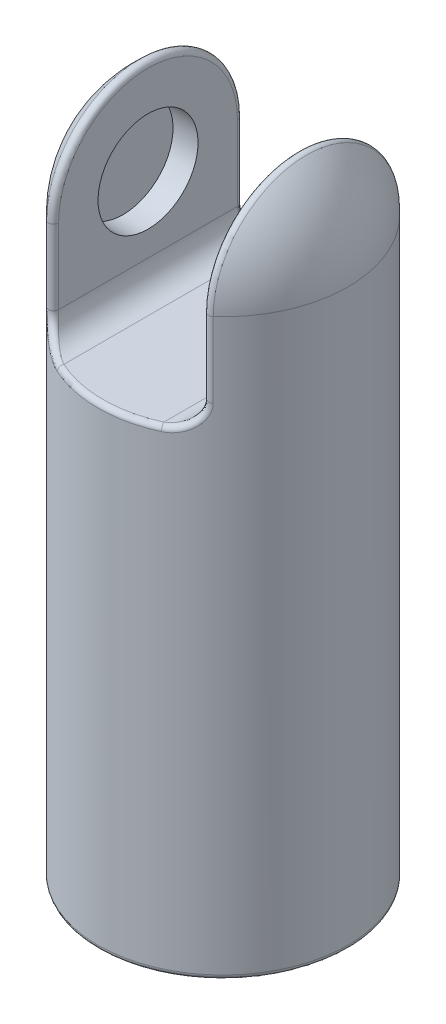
ISO-10303-21;
HEADER;
FILE_DESCRIPTION(('STEP AP214'),'2;1');
FILE_NAME('part.step','',(''),(''),'','','');
FILE_SCHEMA(('AUTOMOTIVE_DESIGN { 1 0 10303 214 1 1 1 1 }'));
ENDSEC;
DATA;
#1=APPLICATION_CONTEXT('core data for automotive mechanical design processes');
#2=APPLICATION_PROTOCOL_DEFINITION('international standard','automotive_design',2000,#1);
#3=PRODUCT_CONTEXT('',#1,'mechanical');
#4=PRODUCT('Part','Part','',(#3));
#5=PRODUCT_RELATED_PRODUCT_CATEGORY('part','',(#4));
#6=PRODUCT_DEFINITION_FORMATION('','',#4);
#7=PRODUCT_DEFINITION_CONTEXT('part definition',#1,'design');
#8=PRODUCT_DEFINITION('design','',#6,#7);
#9=PRODUCT_DEFINITION_SHAPE('','',#8);
#10=(LENGTH_UNIT() NAMED_UNIT(*) SI_UNIT(.MILLI.,.METRE.));
#11=(NAMED_UNIT(*) PLANE_ANGLE_UNIT() SI_UNIT($,.RADIAN.));
#12=(NAMED_UNIT(*) SI_UNIT($,.STERADIAN.) SOLID_ANGLE_UNIT());
#13=UNCERTAINTY_MEASURE_WITH_UNIT(LENGTH_MEASURE(1.E-05),#10,'distance_accuracy_value','');
#14=(GEOMETRIC_REPRESENTATION_CONTEXT(3) GLOBAL_UNCERTAINTY_ASSIGNED_CONTEXT((#13)) GLOBAL_UNIT_ASSIGNED_CONTEXT((#10,
#11,#12)) REPRESENTATION_CONTEXT('',''));
#15=CARTESIAN_POINT('',(0.,0.,0.));
#16=DIRECTION('',(0.,0.,1.));
#17=DIRECTION('',(1.,0.,0.));
#18=AXIS2_PLACEMENT_3D('',#15,#16,#17);
#19=CARTESIAN_POINT('',(0.,11.5,0.));
#20=DIRECTION('',(0.,1.,0.));
#21=DIRECTION('',(1.,0.,0.));
#22=AXIS2_PLACEMENT_3D('',#19,#20,#21);
#23=SPHERICAL_SURFACE('',#22,2.5);
#24=CARTESIAN_POINT('',(0.,11.5,0.));
#25=DIRECTION('',(0.,1.,0.));
#26=DIRECTION('',(0.,0.,1.));
#27=AXIS2_PLACEMENT_3D('',#24,#25,#26);
#28=CIRCLE('',#27,2.5);
#29=CARTESIAN_POINT('',(-1.66666666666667,11.5,-1.86338998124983));
#30=VERTEX_POINT('',#29);
#31=CARTESIAN_POINT('',(-1.66666666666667,11.5,1.86338998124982));
#32=VERTEX_POINT('',#31);
#33=EDGE_CURVE('E143',#30,#32,#28,.T.);
#34=ORIENTED_EDGE('',*,*,#33,.T.);
#35=CARTESIAN_POINT('',(-1.66666666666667,11.5,0.));
#36=DIRECTION('',(1.,0.,0.));
#37=DIRECTION('',(0.,1.,0.));
#38=AXIS2_PLACEMENT_3D('',#35,#36,#37);
#39=CIRCLE('',#38,1.86338998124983);
#40=EDGE_CURVE('E134',#32,#30,#39,.F.);
#41=ORIENTED_EDGE('',*,*,#40,.T.);
#42=EDGE_LOOP('',(#34,#41));
#43=FACE_BOUND('',#42,.T.);
#44=ADVANCED_FACE('F38',(#43),#23,.T.);
#45=CARTESIAN_POINT('',(0.,0.,0.));
#46=DIRECTION('',(0.,1.,0.));
#47=DIRECTION('',(0.,0.,1.));
#48=AXIS2_PLACEMENT_3D('',#45,#46,#47);
#49=PLANE('',#48);
#50=CARTESIAN_POINT('',(0.,0.,0.));
#51=DIRECTION('',(0.,1.,0.));
#52=DIRECTION('',(0.,0.,1.));
#53=AXIS2_PLACEMENT_3D('',#50,#51,#52);
#54=CIRCLE('',#53,2.4);
#55=CARTESIAN_POINT('',(0.,0.,2.4));
#56=VERTEX_POINT('',#55);
#57=EDGE_CURVE('E13',#56,#56,#54,.F.);
#58=ORIENTED_EDGE('',*,*,#57,.T.);
#59=EDGE_LOOP('',(#58));
#60=FACE_BOUND('',#59,.T.);
#61=ADVANCED_FACE('F281',(#60),#49,.F.);
#62=CARTESIAN_POINT('',(0.,2.99521912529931,0.));
#63=DIRECTION('',(0.,1.,0.));
#64=DIRECTION('',(0.,0.,1.));
#65=AXIS2_PLACEMENT_3D('',#62,#63,#64);
#66=CYLINDRICAL_SURFACE('',#65,2.5);
#67=CARTESIAN_POINT('',(0.,0.0999999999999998,0.));
#68=DIRECTION('',(0.,1.,0.));
#69=DIRECTION('',(0.,0.,1.));
#70=AXIS2_PLACEMENT_3D('',#67,#68,#69);
#71=CIRCLE('',#70,2.5);
#72=CARTESIAN_POINT('',(0.,0.0999999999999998,2.5));
#73=VERTEX_POINT('',#72);
#74=EDGE_CURVE('E46',#73,#73,#71,.T.);
#75=ORIENTED_EDGE('',*,*,#74,.T.);
#76=EDGE_LOOP('',(#75));
#77=FACE_BOUND('',#76,.T.);
#78=CARTESIAN_POINT('',(0.834645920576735,9.5281334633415,-2.26218419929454));
#79=CARTESIAN_POINT('',(0.846083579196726,9.52412541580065,-2.29842706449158));
#80=CARTESIAN_POINT('',(0.846177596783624,9.49708644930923,-2.32543290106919));
#81=CARTESIAN_POINT('',(0.846271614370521,9.4700474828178,-2.35243873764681));
#82=CARTESIAN_POINT('',(0.834974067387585,9.4337601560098,-2.35644187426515));
#83=CARTESIAN_POINT('',(0.861800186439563,9.51860071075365,-2.25066892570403));
#84=CARTESIAN_POINT('',(0.874303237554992,9.51494577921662,-2.28703138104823));
#85=CARTESIAN_POINT('',(0.876302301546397,9.48731041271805,-2.31398340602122));
#86=CARTESIAN_POINT('',(0.878386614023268,9.45963336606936,-2.34090892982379));
#87=CARTESIAN_POINT('',(0.868916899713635,9.42232085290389,-2.3444467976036));
#88=CARTESIAN_POINT('',(0.889444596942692,9.51155971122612,-2.23809296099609));
#89=CARTESIAN_POINT('',(0.902994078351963,9.50844406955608,-2.27462350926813));
#90=CARTESIAN_POINT('',(0.906975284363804,9.48030459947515,-2.30152021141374));
#91=CARTESIAN_POINT('',(0.911071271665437,9.45214489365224,-2.32836893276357));
#92=CARTESIAN_POINT('',(0.903472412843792,9.4138716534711,-2.33134683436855));
#93=CARTESIAN_POINT('',(0.944823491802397,9.50226941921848,-2.21117224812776));
#94=CARTESIAN_POINT('',(0.960345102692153,9.50050259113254,-2.24816741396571));
#95=CARTESIAN_POINT('',(0.968377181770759,9.47161173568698,-2.27493744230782));
#96=CARTESIAN_POINT('',(0.976519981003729,9.44270919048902,-2.30165782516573));
#97=CARTESIAN_POINT('',(0.972696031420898,9.40272330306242,-2.30330442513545));
#98=CARTESIAN_POINT('',(0.972557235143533,9.50000202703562,-2.19683440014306));
#99=CARTESIAN_POINT('',(0.989035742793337,9.4990579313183,-2.23410536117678));
#100=CARTESIAN_POINT('',(0.999105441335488,9.46990458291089,-2.26082433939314));
#101=CARTESIAN_POINT('',(1.00931877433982,9.44075621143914,-2.28747274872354));
#102=CARTESIAN_POINT('',(1.00736321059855,9.40000243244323,-2.28836916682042));
#103=CARTESIAN_POINT('',(1.03174645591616,9.49999765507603,-2.16428365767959));
#104=CARTESIAN_POINT('',(1.05007531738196,9.50109538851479,-2.20229465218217));
#105=CARTESIAN_POINT('',(1.064580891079,9.47164318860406,-2.22889964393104));
#106=CARTESIAN_POINT('',(1.07927911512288,9.44219475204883,-2.25541132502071));
#107=CARTESIAN_POINT('',(1.08134973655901,9.39999718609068,-2.25446214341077));
#108=CARTESIAN_POINT('',(1.06310351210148,9.50302691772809,-2.14581568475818));
#109=CARTESIAN_POINT('',(1.08230338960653,9.5054193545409,-2.18429559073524));
#110=CARTESIAN_POINT('',(1.09920262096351,9.47593903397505,-2.21085513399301));
#111=CARTESIAN_POINT('',(1.11633203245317,9.44650916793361,-2.23728689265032));
#112=CARTESIAN_POINT('',(1.12054605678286,9.40363230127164,-2.23522467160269));
#113=CARTESIAN_POINT('',(1.12417334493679,9.51466590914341,-2.10748497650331));
#114=CARTESIAN_POINT('',(1.14468481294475,9.51985318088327,-2.1471327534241));
#115=CARTESIAN_POINT('',(1.1664057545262,9.49066390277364,-2.1735800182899));
#116=CARTESIAN_POINT('',(1.18835889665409,9.46152548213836,-2.19989860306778));
#117=CARTESIAN_POINT('',(1.19688334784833,9.41759909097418,-2.19529685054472));
#118=CARTESIAN_POINT('',(1.15388376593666,9.52328341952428,-2.08762033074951));
#119=CARTESIAN_POINT('',(1.17486065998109,9.5300205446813,-2.12793553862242));
#120=CARTESIAN_POINT('',(1.19898424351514,9.50110147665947,-2.15434779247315));
#121=CARTESIAN_POINT('',(1.22336145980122,9.47229027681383,-2.18060137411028));
#122=CARTESIAN_POINT('',(1.23402137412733,9.4279401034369,-2.17460451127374));
#123=CARTESIAN_POINT('',(1.21085248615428,9.54560569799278,-2.0473160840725));
#124=CARTESIAN_POINT('',(1.23221641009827,9.55546653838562,-2.08922656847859));
#125=CARTESIAN_POINT('',(1.26112162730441,9.5274466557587,-2.11555497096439));
#126=CARTESIAN_POINT('',(1.29028026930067,9.49953388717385,-2.14172548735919));
#127=CARTESIAN_POINT('',(1.30523227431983,9.4547268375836,-2.13262092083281));
#128=CARTESIAN_POINT('',(1.23811977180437,9.55929078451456,-2.0268789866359));
#129=CARTESIAN_POINT('',(1.25941693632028,9.57078219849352,-2.06969078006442));
#130=CARTESIAN_POINT('',(1.29069164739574,9.54333308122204,-2.09599592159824));
#131=CARTESIAN_POINT('',(1.32222234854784,9.51605339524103,-2.12212284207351));
#132=CARTESIAN_POINT('',(1.33931638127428,9.47114894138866,-2.11133227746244));
#133=CARTESIAN_POINT('',(1.28982478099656,9.59143037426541,-1.98616244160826));
#134=CARTESIAN_POINT('',(1.31036937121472,9.60596564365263,-2.03107249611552));
#135=CARTESIAN_POINT('',(1.34631657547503,9.58003781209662,-2.0573313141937));
#136=CARTESIAN_POINT('',(1.38252234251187,9.55428007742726,-2.08341069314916));
#137=CARTESIAN_POINT('',(1.40394764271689,9.50971644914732,-2.06891920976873));
#138=CARTESIAN_POINT('',(1.31425971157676,9.6098895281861,-1.965883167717));
#139=CARTESIAN_POINT('',(1.33410729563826,9.62589543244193,-2.01197826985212));
#140=CARTESIAN_POINT('',(1.37236801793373,9.60086092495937,-2.0382262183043));
#141=CARTESIAN_POINT('',(1.41086884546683,9.57605711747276,-2.06428983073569));
#142=CARTESIAN_POINT('',(1.43449130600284,9.53186743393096,-2.04779496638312));
#143=CARTESIAN_POINT('',(1.36095251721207,9.65248497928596,-1.92544974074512));
#144=CARTESIAN_POINT('',(1.37871480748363,9.67092839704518,-1.97428983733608));
#145=CARTESIAN_POINT('',(1.42156569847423,9.64813733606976,-2.00054408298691));
#146=CARTESIAN_POINT('',(1.46468442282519,9.62560367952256,-2.02659364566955));
#147=CARTESIAN_POINT('',(1.49285731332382,9.5829819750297,-2.00567681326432));
#148=CARTESIAN_POINT('',(1.38302139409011,9.67687415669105,-1.90536156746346));
#149=CARTESIAN_POINT('',(1.39931113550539,9.69629704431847,-1.9557974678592));
#150=CARTESIAN_POINT('',(1.44447886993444,9.67483407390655,-1.98205136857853));
#151=CARTESIAN_POINT('',(1.48986294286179,9.65368544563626,-2.00812322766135));
#152=CARTESIAN_POINT('',(1.52044340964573,9.61224898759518,-1.98475163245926));
#153=CARTESIAN_POINT('',(1.42247517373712,9.7305253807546,-1.86813931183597));
#154=CARTESIAN_POINT('',(1.43523382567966,9.75061625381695,-1.92203914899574));
#155=CARTESIAN_POINT('',(1.48470697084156,9.73230908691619,-1.94833858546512));
#156=CARTESIAN_POINT('',(1.53439622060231,9.71430537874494,-1.97445766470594));
#157=CARTESIAN_POINT('',(1.56976063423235,9.67663045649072,-1.9459784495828));
#158=CARTESIAN_POINT('',(1.43987235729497,9.7597743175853,-1.85099752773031));
#159=CARTESIAN_POINT('',(1.45050956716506,9.77958448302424,-1.90680669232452));
#160=CARTESIAN_POINT('',(1.50203660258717,9.76307633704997,-1.93310995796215));
#161=CARTESIAN_POINT('',(1.55369401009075,9.746867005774,-1.95929639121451));
#162=CARTESIAN_POINT('',(1.59150711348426,9.71172918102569,-1.92812242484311));
#163=CARTESIAN_POINT('',(1.46346833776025,9.81111498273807,-1.82717518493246));
#164=CARTESIAN_POINT('',(1.4706204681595,9.828806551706,-1.88601649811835));
#165=CARTESIAN_POINT('',(1.52503235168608,9.81568389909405,-1.91235267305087));
#166=CARTESIAN_POINT('',(1.57949956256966,9.80268746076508,-1.93863836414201));
#167=CARTESIAN_POINT('',(1.62100208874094,9.77333797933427,-1.90330748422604));
#168=CARTESIAN_POINT('',(1.47143487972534,9.83190440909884,-1.818962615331));
#169=CARTESIAN_POINT('',(1.47722408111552,9.84840449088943,-1.87896164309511));
#170=CARTESIAN_POINT('',(1.53264563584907,9.83666641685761,-1.90531417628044));
#171=CARTESIAN_POINT('',(1.588096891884,9.82503085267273,-1.93163882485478));
#172=CARTESIAN_POINT('',(1.63096026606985,9.79828529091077,-1.89475272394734));
#173=CARTESIAN_POINT('',(1.48461151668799,9.87488015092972,-1.80523132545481));
#174=CARTESIAN_POINT('',(1.48796210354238,9.88819227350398,-1.86727878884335));
#175=CARTESIAN_POINT('',(1.54507042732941,9.87935871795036,-1.89368265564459));
#176=CARTESIAN_POINT('',(1.60220826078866,9.87062610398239,-1.92005897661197));
#177=CARTESIAN_POINT('',(1.64743106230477,9.8498561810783,-1.88044929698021));
#178=CARTESIAN_POINT('',(1.48982926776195,9.89706239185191,-1.79970512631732));
#179=CARTESIAN_POINT('',(1.49208310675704,9.90835157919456,-1.86266486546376));
#180=CARTESIAN_POINT('',(1.54988972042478,9.90106630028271,-1.88908283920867));
#181=CARTESIAN_POINT('',(1.60770500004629,9.89384342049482,-1.91549264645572));
#182=CARTESIAN_POINT('',(1.65395325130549,9.87647487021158,-1.87469283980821));
#183=CARTESIAN_POINT('',(1.49779539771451,9.9460593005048,-1.79123123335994));
#184=CARTESIAN_POINT('',(1.4983304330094,9.95234062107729,-1.85561262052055));
#185=CARTESIAN_POINT('',(1.55719700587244,9.94847181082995,-1.88207146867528));
#186=CARTESIAN_POINT('',(1.61607770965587,9.94468746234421,-1.90851658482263));
#187=CARTESIAN_POINT('',(1.66391091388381,9.93527116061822,-1.86586586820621));
#188=CARTESIAN_POINT('',(1.50000071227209,9.97303848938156,-1.7888526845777));
#189=CARTESIAN_POINT('',(1.49999932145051,9.97615355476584,-1.85367691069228));
#190=CARTESIAN_POINT('',(1.5591751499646,9.97424198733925,-1.88014051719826));
#191=CARTESIAN_POINT('',(1.61835012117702,9.97232497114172,-1.90660484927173));
#192=CARTESIAN_POINT('',(1.66666755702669,9.96764618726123,-1.86338821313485));
#193=CARTESIAN_POINT('',(1.49999937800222,10.0235443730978,-1.78885586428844));
#194=CARTESIAN_POINT('',(1.50000059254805,10.0208240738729,-1.85367807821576));
#195=CARTESIAN_POINT('',(1.55917518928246,10.0224934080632,-1.88014231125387));
#196=CARTESIAN_POINT('',(1.61835053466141,10.0241674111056,-1.90660591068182));
#197=CARTESIAN_POINT('',(1.66666588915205,10.0282532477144,-1.86339152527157));
#198=CARTESIAN_POINT('',(1.49831648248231,10.0470752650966,-1.79067247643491));
#199=CARTESIAN_POINT('',(1.4987287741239,10.041612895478,-1.85515553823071));
#200=CARTESIAN_POINT('',(1.55766672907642,10.0449775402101,-1.8816163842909));
#201=CARTESIAN_POINT('',(1.61661763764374,10.0482928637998,-1.90806499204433));
#202=CARTESIAN_POINT('',(1.66456226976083,10.0564903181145,-1.86528382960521));
#203=CARTESIAN_POINT('',(1.49175925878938,10.0934599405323,-1.79765252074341));
#204=CARTESIAN_POINT('',(1.49359590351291,10.0830712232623,-1.86095807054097));
#205=CARTESIAN_POINT('',(1.55166234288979,10.0896998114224,-1.88738231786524));
#206=CARTESIAN_POINT('',(1.60973109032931,10.0962639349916,-1.91380414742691));
#207=CARTESIAN_POINT('',(1.65636574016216,10.1121519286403,-1.87255470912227));
#208=CARTESIAN_POINT('',(1.48686919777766,10.1163098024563,-1.80283245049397));
#209=CARTESIAN_POINT('',(1.48973473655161,10.1036913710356,-1.86528308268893));
#210=CARTESIAN_POINT('',(1.54715168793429,10.1119361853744,-1.89168806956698));
#211=CARTESIAN_POINT('',(1.60457741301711,10.1200521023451,-1.91808417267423));
#212=CARTESIAN_POINT('',(1.6502531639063,10.1395717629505,-1.87795046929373));
#213=CARTESIAN_POINT('',(1.48047181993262,10.138372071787,-1.80954112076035));
#214=CARTESIAN_POINT('',(1.48457030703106,10.1241408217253,-1.87096297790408));
#215=CARTESIAN_POINT('',(1.54116244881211,10.1338213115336,-1.89733698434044));
#216=CARTESIAN_POINT('',(1.59775459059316,10.1435018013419,-1.9237109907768));
#217=CARTESIAN_POINT('',(1.64225644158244,10.1660464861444,-1.8849386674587));
#218=(BOUNDED_SURFACE() B_SPLINE_SURFACE(3,2,((#78,#79,#80,#81,#82),(#83,#84,#85,#86,#87),(#88,
#89,#90,#91,#92),(#93,#94,#95,#96,#97),(#98,#99,#100,#101,#102),(#103,#104,#105,#106,#107),
(#108,#109,#110,#111,#112),(#113,#114,#115,#116,#117),(#118,#119,#120,#121,#122),(#123,#124,
#125,#126,#127),(#128,#129,#130,#131,#132),(#133,#134,#135,#136,#137),(#138,#139,#140,#141,
#142),(#143,#144,#145,#146,#147),(#148,#149,#150,#151,#152),(#153,#154,#155,#156,#157),(#158,
#159,#160,#161,#162),(#163,#164,#165,#166,#167),(#168,#169,#170,#171,#172),(#173,#174,#175,#176,
#177),(#178,#179,#180,#181,#182),(#183,#184,#185,#186,#187),(#188,#189,#190,#191,#192),(#193,
#194,#195,#196,#197),(#198,#199,#200,#201,#202),(#203,#204,#205,#206,#207),(#208,#209,#210,#211,
#212),(#213,#214,#215,#216,#217)),.UNSPECIFIED.,.F.,.F.,.F.) B_SPLINE_SURFACE_WITH_KNOTS((4,2,2,
2,2,2,2,2,2,2,2,2,2,4),(3,2,3),(0.,0.108957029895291,0.217500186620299,0.343065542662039,
0.468806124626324,0.594063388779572,0.719443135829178,0.851598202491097,0.983402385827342,
1.06693139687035,1.15022651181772,1.24713718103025,1.33176526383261,1.41681162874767),(0.,0.5,
1.),.UNSPECIFIED.) GEOMETRIC_REPRESENTATION_ITEM() RATIONAL_B_SPLINE_SURFACE(((1.,
0.934113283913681,1.,0.934113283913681,1.),(1.,0.932894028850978,1.,0.932894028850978,1.),(1.,
0.931428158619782,1.,0.931428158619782,1.),(1.,0.928013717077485,1.,0.928013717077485,1.),(1.,
0.926067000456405,1.,0.926067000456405,1.),(1.,0.921349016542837,1.,0.921349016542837,1.),(1.,
0.918496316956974,1.,0.918496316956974,1.),(1.,0.91219850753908,1.,0.91219850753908,1.),(1.,
0.908752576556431,1.,0.908752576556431,1.),(1.,0.901367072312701,1.,0.901367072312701,1.),(1.,
0.89742944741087,1.,0.89742944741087,1.),(1.,0.889166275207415,1.,0.889166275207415,1.),(1.,
0.884840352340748,1.,0.884840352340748,1.),(1.,0.875759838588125,1.,0.875759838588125,1.),(1.,
0.870994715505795,1.,0.870994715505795,1.),(1.,0.8616818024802,1.,0.8616818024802,1.),(1.,
0.857133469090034,1.,0.857133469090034,1.),(1.,0.850526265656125,1.,0.850526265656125,1.),(1.,
0.848165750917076,1.,0.848165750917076,1.),(1.,0.844133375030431,1.,0.844133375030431,1.),(1.,
0.842459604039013,1.,0.842459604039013,1.),(1.,0.839868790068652,1.,0.839868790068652,1.),(1.,
0.839120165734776,1.,0.839120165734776,1.),(1.,0.839121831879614,1.,0.839121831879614,1.),(1.,
0.83969417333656,1.,0.83969417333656,1.),(1.,0.841832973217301,1.,0.841832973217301,1.),(1.,
0.843404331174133,1.,0.843404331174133,1.),(1.,0.845396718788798,1.,0.845396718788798,1.))) REPRESENTATION_ITEM('') SURFACE());
#219=CARTESIAN_POINT('',(0.834974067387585,9.4337601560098,-2.35644187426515));
#220=CARTESIAN_POINT('',(0.868916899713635,9.42232085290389,-2.3444467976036));
#221=CARTESIAN_POINT('',(0.903472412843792,9.4138716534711,-2.33134683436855));
#222=CARTESIAN_POINT('',(0.972696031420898,9.40272330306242,-2.30330442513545));
#223=CARTESIAN_POINT('',(1.00736321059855,9.40000243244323,-2.28836916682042));
#224=CARTESIAN_POINT('',(1.08134973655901,9.39999718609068,-2.25446214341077));
#225=CARTESIAN_POINT('',(1.12054605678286,9.40363230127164,-2.23522467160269));
#226=CARTESIAN_POINT('',(1.19688334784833,9.41759909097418,-2.19529685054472));
#227=CARTESIAN_POINT('',(1.23402137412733,9.4279401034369,-2.17460451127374));
#228=CARTESIAN_POINT('',(1.30523227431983,9.4547268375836,-2.13262092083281));
#229=CARTESIAN_POINT('',(1.33931638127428,9.47114894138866,-2.11133227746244));
#230=CARTESIAN_POINT('',(1.40394764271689,9.50971644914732,-2.06891920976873));
#231=CARTESIAN_POINT('',(1.43449130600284,9.53186743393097,-2.04779496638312));
#232=CARTESIAN_POINT('',(1.49285731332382,9.5829819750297,-2.00567681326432));
#233=CARTESIAN_POINT('',(1.52044340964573,9.61224898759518,-1.98475163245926));
#234=CARTESIAN_POINT('',(1.56976063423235,9.67663045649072,-1.9459784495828));
#235=CARTESIAN_POINT('',(1.59150711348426,9.7117291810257,-1.92812242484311));
#236=CARTESIAN_POINT('',(1.62100208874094,9.77333797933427,-1.90330748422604));
#237=CARTESIAN_POINT('',(1.63096026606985,9.79828529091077,-1.89475272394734));
#238=CARTESIAN_POINT('',(1.64743106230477,9.8498561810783,-1.88044929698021));
#239=CARTESIAN_POINT('',(1.65395325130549,9.87647487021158,-1.87469283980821));
#240=CARTESIAN_POINT('',(1.66391091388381,9.93527116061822,-1.86586586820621));
#241=CARTESIAN_POINT('',(1.66666755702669,9.96764618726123,-1.86338821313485));
#242=CARTESIAN_POINT('',(1.66666588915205,10.0282532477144,-1.86339152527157));
#243=CARTESIAN_POINT('',(1.66456226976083,10.0564903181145,-1.86528382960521));
#244=CARTESIAN_POINT('',(1.65636574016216,10.1121519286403,-1.87255470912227));
#245=CARTESIAN_POINT('',(1.6502531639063,10.1395717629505,-1.87795046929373));
#246=CARTESIAN_POINT('',(1.64225644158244,10.1660464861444,-1.8849386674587));
#247=B_SPLINE_CURVE_WITH_KNOTS('',3,(#219,#220,#221,#222,#223,#224,#225,#226,#227,#228,#229,
#230,#231,#232,#233,#234,#235,#236,#237,#238,#239,#240,#241,#242,#243,#244,#245,#246),
.UNSPECIFIED.,.F.,.F.,(4,2,2,2,2,2,2,2,2,2,2,2,2,4),(0.,0.108957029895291,0.217500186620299,
0.343065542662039,0.468806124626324,0.594063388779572,0.719443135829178,0.851598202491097,
0.983402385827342,1.06693139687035,1.15022651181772,1.24713718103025,1.33176526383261,
1.41681162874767),.UNSPECIFIED.);
#248=CARTESIAN_POINT('',(1.04166666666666,9.4,-2.27264835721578));
#249=VERTEX_POINT('',#248);
#250=CARTESIAN_POINT('',(1.66666666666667,10.,-1.86338998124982));
#251=VERTEX_POINT('',#250);
#252=EDGE_CURVE('E371',#249,#251,#247,.T.);
#253=ORIENTED_EDGE('',*,*,#252,.T.);
#254=DIRECTION('',(0.,1.,0.));
#255=VECTOR('',#254,1.);
#256=CARTESIAN_POINT('',(1.66666666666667,2.99521912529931,-1.86338998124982));
#257=LINE('',#256,#255);
#258=CARTESIAN_POINT('',(1.66666666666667,11.5,-1.86338998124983));
#259=VERTEX_POINT('',#258);
#260=EDGE_CURVE('E142',#251,#259,#257,.T.);
#261=ORIENTED_EDGE('',*,*,#260,.T.);
#262=CARTESIAN_POINT('',(1.66666666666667,11.5,1.86338998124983));
#263=VERTEX_POINT('',#262);
#264=EDGE_CURVE('E129',#263,#259,#28,.T.);
#265=ORIENTED_EDGE('',*,*,#264,.F.);
#266=DIRECTION('',(0.,1.,0.));
#267=VECTOR('',#266,1.);
#268=CARTESIAN_POINT('',(1.66666666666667,2.99521912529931,1.86338998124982));
#269=LINE('',#268,#267);
#270=CARTESIAN_POINT('',(1.66666666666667,10.,1.86338998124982));
#271=VERTEX_POINT('',#270);
#272=EDGE_CURVE('E139',#263,#271,#269,.F.);
#273=ORIENTED_EDGE('',*,*,#272,.T.);
#274=CARTESIAN_POINT('',(1.48047181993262,10.138372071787,1.80954112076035));
#275=CARTESIAN_POINT('',(1.48457030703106,10.1241408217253,1.87096297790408));
#276=CARTESIAN_POINT('',(1.54116244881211,10.1338213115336,1.89733698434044));
#277=CARTESIAN_POINT('',(1.59775459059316,10.1435018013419,1.9237109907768));
#278=CARTESIAN_POINT('',(1.64225644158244,10.1660464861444,1.8849386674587));
#279=CARTESIAN_POINT('',(1.48686789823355,10.1163266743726,1.80283312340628));
#280=CARTESIAN_POINT('',(1.48973231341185,10.1037090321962,1.86528470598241));
#281=CARTESIAN_POINT('',(1.54714958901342,10.1119543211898,1.89168935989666));
#282=CARTESIAN_POINT('',(1.60457491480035,10.1200720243,1.91808584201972));
#283=CARTESIAN_POINT('',(1.65025153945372,10.1395920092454,1.87795117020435));
#284=CARTESIAN_POINT('',(1.49175526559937,10.0934859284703,1.79765642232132));
#285=CARTESIAN_POINT('',(1.49359209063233,10.083095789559,1.86096183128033));
#286=CARTESIAN_POINT('',(1.55165823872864,10.0897258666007,1.88738590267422));
#287=CARTESIAN_POINT('',(1.60972634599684,10.0962920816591,1.91380789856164));
#288=CARTESIAN_POINT('',(1.65636074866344,10.1121831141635,1.87255877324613));
#289=CARTESIAN_POINT('',(1.49831377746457,10.0470964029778,1.79067572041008));
#290=CARTESIAN_POINT('',(1.49872737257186,10.0416305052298,1.85515769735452));
#291=CARTESIAN_POINT('',(1.55766471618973,10.0449969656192,1.88161868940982));
#292=CARTESIAN_POINT('',(1.61661537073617,10.0483135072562,1.90806709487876));
#293=CARTESIAN_POINT('',(1.66455888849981,10.0565156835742,1.86528720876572));
#294=CARTESIAN_POINT('',(1.49999742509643,10.023550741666,1.78885860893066));
#295=CARTESIAN_POINT('',(1.50000037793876,10.0208276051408,1.85367937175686));
#296=CARTESIAN_POINT('',(1.5591742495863,10.0224979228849,1.88014389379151));
#297=CARTESIAN_POINT('',(1.61834953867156,10.0241719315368,1.90660713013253));
#298=CARTESIAN_POINT('',(1.66666344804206,10.0282608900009,1.8633943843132));
#299=CARTESIAN_POINT('',(1.5000025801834,9.97640096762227,1.7888501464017));
#300=CARTESIAN_POINT('',(1.49999962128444,9.97912958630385,1.8536756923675));
#301=CARTESIAN_POINT('',(1.55917609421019,9.97745594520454,1.88013905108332));
#302=CARTESIAN_POINT('',(1.61835114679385,9.97577838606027,1.90660369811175));
#303=CARTESIAN_POINT('',(1.66666989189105,9.971681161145,1.86338556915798));
#304=CARTESIAN_POINT('',(1.49831718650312,9.95279683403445,1.79066623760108));
#305=CARTESIAN_POINT('',(1.49872062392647,9.95829123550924,1.8551564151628));
#306=CARTESIAN_POINT('',(1.55766221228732,9.95491301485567,1.88161504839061));
#307=CARTESIAN_POINT('',(1.61661145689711,9.9515922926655,1.90806623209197));
#308=CARTESIAN_POINT('',(1.66456314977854,9.9433562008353,1.86527733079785));
#309=CARTESIAN_POINT('',(1.49172472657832,9.9064302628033,1.7976948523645));
#310=CARTESIAN_POINT('',(1.49357779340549,9.9168124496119,1.86098698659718));
#311=CARTESIAN_POINT('',(1.55163597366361,9.91018024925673,1.88741339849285));
#312=CARTESIAN_POINT('',(1.60970197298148,9.90360542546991,1.91383236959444));
#313=CARTESIAN_POINT('',(1.65632257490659,9.88771631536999,1.87259880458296));
#314=CARTESIAN_POINT('',(1.48681822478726,9.8836676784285,1.80290678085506));
#315=CARTESIAN_POINT('',(1.48972723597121,9.89622154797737,1.86532195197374));
#316=CARTESIAN_POINT('',(1.54712414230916,9.88799035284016,1.89173525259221));
#317=CARTESIAN_POINT('',(1.60454989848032,9.8798615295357,1.91812124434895));
#318=CARTESIAN_POINT('',(1.65018944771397,9.86040121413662,1.87802789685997));
#319=CARTESIAN_POINT('',(1.47417075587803,9.83974563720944,1.81612806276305));
#320=CARTESIAN_POINT('',(1.47947381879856,9.85573546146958,1.87653788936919));
#321=CARTESIAN_POINT('',(1.53524334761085,9.84452285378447,1.9028986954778));
#322=CARTESIAN_POINT('',(1.59103892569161,9.83340869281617,1.92923522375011));
#323=CARTESIAN_POINT('',(1.63438011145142,9.80769476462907,1.8918000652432));
#324=CARTESIAN_POINT('',(1.46645028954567,9.81857588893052,1.82411716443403));
#325=CARTESIAN_POINT('',(1.4731101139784,9.83586940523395,1.88337889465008));
#326=CARTESIAN_POINT('',(1.52789502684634,9.82323986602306,1.90972206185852));
#327=CARTESIAN_POINT('',(1.58272980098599,9.81073041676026,1.93602056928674));
#328=CARTESIAN_POINT('',(1.62472952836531,9.78229106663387,1.90012204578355));
#329=CARTESIAN_POINT('',(1.44855916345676,9.77799170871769,1.84226057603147));
#330=CARTESIAN_POINT('',(1.45792914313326,9.79706777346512,1.89918089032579));
#331=CARTESIAN_POINT('',(1.51053272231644,9.78180596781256,1.92547347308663));
#332=CARTESIAN_POINT('',(1.56318978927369,9.76667071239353,1.95171695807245));
#333=CARTESIAN_POINT('',(1.602365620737,9.73359005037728,1.919021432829));
#334=CARTESIAN_POINT('',(1.43838526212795,9.75857964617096,1.8524177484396));
#335=CARTESIAN_POINT('',(1.44913098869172,9.77814789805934,1.9081239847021));
#336=CARTESIAN_POINT('',(1.5005152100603,9.76165659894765,1.93440430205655));
#337=CARTESIAN_POINT('',(1.5519824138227,9.74530600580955,1.96061013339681));
#338=CARTESIAN_POINT('',(1.58964824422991,9.71029557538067,1.92960182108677));
#339=CARTESIAN_POINT('',(1.39598314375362,9.688874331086,1.89370517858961));
#340=CARTESIAN_POINT('',(1.41169789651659,9.70947921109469,1.9448360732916));
#341=CARTESIAN_POINT('',(1.4580394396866,9.68833866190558,1.97123682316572));
#342=CARTESIAN_POINT('',(1.50493043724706,9.66815346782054,1.9971680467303));
#343=CARTESIAN_POINT('',(1.536645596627,9.62664919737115,1.97260956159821));
#344=CARTESIAN_POINT('',(1.35665884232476,9.64491675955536,1.93006532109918));
#345=CARTESIAN_POINT('',(1.37525192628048,9.66348291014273,1.97822090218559));
#346=CARTESIAN_POINT('',(1.41730671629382,9.64003365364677,2.00467756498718));
#347=CARTESIAN_POINT('',(1.46023298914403,9.61727976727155,2.03050543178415));
#348=CARTESIAN_POINT('',(1.48749021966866,9.57390011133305,2.01048470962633));
#349=CARTESIAN_POINT('',(1.26625471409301,9.57279200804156,2.00582915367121));
#350=CARTESIAN_POINT('',(1.2878793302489,9.58632035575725,2.04925689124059));
#351=CARTESIAN_POINT('',(1.32128335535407,9.55913671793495,2.07578077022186));
#352=CARTESIAN_POINT('',(1.35559838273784,9.5327592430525,2.10161362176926));
#353=CARTESIAN_POINT('',(1.37448505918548,9.4873504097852,2.08940536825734));
#354=CARTESIAN_POINT('',(1.21501218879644,9.5448638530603,2.04526942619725));
#355=CARTESIAN_POINT('',(1.23688819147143,9.55498370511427,2.08699133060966));
#356=CARTESIAN_POINT('',(1.26578954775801,9.52678361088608,2.11349757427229));
#357=CARTESIAN_POINT('',(1.29557533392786,9.49892173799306,2.13946712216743));
#358=CARTESIAN_POINT('',(1.31043190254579,9.45383662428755,2.1304889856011));
#359=CARTESIAN_POINT('',(1.1346415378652,9.51772997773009,2.10047893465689));
#360=CARTESIAN_POINT('',(1.15529956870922,9.52346211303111,2.14037220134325));
#361=CARTESIAN_POINT('',(1.17788636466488,9.49437124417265,2.16679688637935));
#362=CARTESIAN_POINT('',(1.20066927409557,9.46534716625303,2.19310285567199));
#363=CARTESIAN_POINT('',(1.20996858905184,9.42127597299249,2.18799889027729));
#364=CARTESIAN_POINT('',(1.10847950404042,9.51115652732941,2.11754935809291));
#365=CARTESIAN_POINT('',(1.12865820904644,9.51558730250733,2.15689419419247));
#366=CARTESIAN_POINT('',(1.14915518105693,9.48630475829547,2.18335297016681));
#367=CARTESIAN_POINT('',(1.16982662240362,9.45705504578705,2.20971642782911));
#368=CARTESIAN_POINT('',(1.17726604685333,9.41338783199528,2.20578058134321));
#369=CARTESIAN_POINT('',(1.05497698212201,9.50229292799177,2.15058078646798));
#370=CARTESIAN_POINT('',(1.07392556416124,9.50435127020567,2.18895360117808));
#371=CARTESIAN_POINT('',(1.09022915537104,9.47488311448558,2.21551173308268));
#372=CARTESIAN_POINT('',(1.10670199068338,9.44544874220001,2.24197760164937));
#373=CARTESIAN_POINT('',(1.11038789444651,9.40275151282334,2.24018831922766));
#374=CARTESIAN_POINT('',(1.02763794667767,9.49999764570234,2.16654309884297));
#375=CARTESIAN_POINT('',(1.04581817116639,9.50095312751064,2.2045132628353));
#376=CARTESIAN_POINT('',(1.06003611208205,9.47152231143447,2.23111553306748));
#377=CARTESIAN_POINT('',(1.07439980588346,9.44209421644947,2.25764741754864));
#378=CARTESIAN_POINT('',(1.07621410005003,9.39999717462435,2.25681572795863));
#379=CARTESIAN_POINT('',(0.972567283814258,9.5000023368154,2.19682888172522));
#380=CARTESIAN_POINT('',(0.989046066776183,9.49905843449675,2.23409997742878));
#381=CARTESIAN_POINT('',(0.999116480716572,9.46990507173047,2.26081902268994));
#382=CARTESIAN_POINT('',(1.00933060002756,9.4407566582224,2.28746732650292));
#383=CARTESIAN_POINT('',(1.00737577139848,9.40000280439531,2.28836341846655));
#384=CARTESIAN_POINT('',(0.944840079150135,9.50226831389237,2.21116364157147));
#385=CARTESIAN_POINT('',(0.960362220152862,9.50050190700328,2.24815898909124));
#386=CARTESIAN_POINT('',(0.968395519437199,9.47161091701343,2.27492902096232));
#387=CARTESIAN_POINT('',(0.976539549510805,9.44270823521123,2.30164932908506));
#388=CARTESIAN_POINT('',(0.972716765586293,9.40272197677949,2.30329545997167));
#389=CARTESIAN_POINT('',(0.889458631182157,9.51155566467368,2.23808669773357));
#390=CARTESIAN_POINT('',(0.903008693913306,9.50844034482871,2.27461731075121));
#391=CARTESIAN_POINT('',(0.906990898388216,9.48030059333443,2.30151394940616));
#392=CARTESIAN_POINT('',(0.911087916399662,9.45214061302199,2.32836266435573));
#393=CARTESIAN_POINT('',(0.903489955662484,9.4138667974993,2.33134031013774));
#394=CARTESIAN_POINT('',(0.861805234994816,9.51859775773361,2.25066709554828));
#395=CARTESIAN_POINT('',(0.874308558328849,9.51494298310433,2.28702953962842));
#396=CARTESIAN_POINT('',(0.876307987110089,9.48730743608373,2.31398147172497));
#397=CARTESIAN_POINT('',(0.878392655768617,9.45963020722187,2.34090705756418));
#398=CARTESIAN_POINT('',(0.868923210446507,9.4223173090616,2.34444489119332));
#399=CARTESIAN_POINT('',(0.834645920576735,9.5281334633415,2.26218419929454));
#400=CARTESIAN_POINT('',(0.846083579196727,9.52412541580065,2.29842706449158));
#401=CARTESIAN_POINT('',(0.846177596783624,9.49708644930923,2.32543290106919));
#402=CARTESIAN_POINT('',(0.846271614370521,9.4700474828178,2.35243873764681));
#403=CARTESIAN_POINT('',(0.834974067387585,9.4337601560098,2.35644187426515));
#404=(BOUNDED_SURFACE() B_SPLINE_SURFACE(3,2,((#274,#275,#276,#277,#278),(#279,#280,#281,#282,
#283),(#284,#285,#286,#287,#288),(#289,#290,#291,#292,#293),(#294,#295,#296,#297,#298),(#299,
#300,#301,#302,#303),(#304,#305,#306,#307,#308),(#309,#310,#311,#312,#313),(#314,#315,#316,#317,
#318),(#319,#320,#321,#322,#323),(#324,#325,#326,#327,#328),(#329,#330,#331,#332,#333),(#334,
#335,#336,#337,#338),(#339,#340,#341,#342,#343),(#344,#345,#346,#347,#348),(#349,#350,#351,#352,
#353),(#354,#355,#356,#357,#358),(#359,#360,#361,#362,#363),(#364,#365,#366,#367,#368),(#369,
#370,#371,#372,#373),(#374,#375,#376,#377,#378),(#379,#380,#381,#382,#383),(#384,#385,#386,#387,
#388),(#389,#390,#391,#392,#393),(#394,#395,#396,#397,#398),(#399,#400,#401,#402,#403)),
.UNSPECIFIED.,.F.,.F.,.F.) B_SPLINE_SURFACE_WITH_KNOTS((4,2,2,2,2,2,2,2,2,2,2,2,4),(3,2,3),(0.,
0.0850034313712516,0.169674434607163,0.25451905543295,0.339348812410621,0.423572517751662,
0.507908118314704,0.741916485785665,0.979329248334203,1.08878568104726,1.19811069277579,
1.30662389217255,1.41561087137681),(0.,0.5,1.),
.UNSPECIFIED.) GEOMETRIC_REPRESENTATION_ITEM() RATIONAL_B_SPLINE_SURFACE(((1.,0.845396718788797,
1.,0.845396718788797,1.),(1.,0.843404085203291,1.,0.843404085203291,1.),(1.,0.841833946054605,
1.,0.841833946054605,1.),(1.,0.839695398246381,1.,0.839695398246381,1.),(1.,0.83912309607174,1.,
0.83912309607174,1.),(1.,0.839119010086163,1.,0.839119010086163,1.),(1.,0.839689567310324,1.,
0.839689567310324,1.),(1.,0.841848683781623,1.,0.841848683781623,1.),(1.,0.843437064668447,1.,
0.843437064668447,1.),(1.,0.847342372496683,1.,0.847342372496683,1.),(1.,0.849654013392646,1.,
0.849654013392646,1.),(1.,0.854727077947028,1.,0.854727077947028,1.),(1.,0.857489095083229,1.,
0.857489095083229,1.),(1.,0.868290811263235,1.,0.868290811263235,1.),(1.,0.876997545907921,1.,
0.876997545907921,1.),(1.,0.893430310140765,1.,0.893430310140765,1.),(1.,0.901140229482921,1.,
0.901140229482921,1.),(1.,0.910984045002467,1.,0.910984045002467,1.),(1.,0.913883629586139,1.,
0.913883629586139,1.),(1.,0.919229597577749,1.,0.919229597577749,1.),(1.,0.92167652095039,1.,
0.92167652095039,1.),(1.,0.926066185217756,1.,0.926066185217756,1.),(1.,0.928012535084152,1.,
0.928012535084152,1.),(1.,0.931427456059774,1.,0.931427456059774,1.),(1.,0.93289390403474,1.,
0.93289390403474,1.),(1.,0.934113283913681,1.,0.934113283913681,1.))) REPRESENTATION_ITEM('') SURFACE());
#405=CARTESIAN_POINT('',(1.64225644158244,10.1660464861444,1.8849386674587));
#406=CARTESIAN_POINT('',(1.65025153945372,10.1395920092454,1.87795117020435));
#407=CARTESIAN_POINT('',(1.65636074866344,10.1121831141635,1.87255877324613));
#408=CARTESIAN_POINT('',(1.66455888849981,10.0565156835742,1.86528720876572));
#409=CARTESIAN_POINT('',(1.66666344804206,10.0282608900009,1.8633943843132));
#410=CARTESIAN_POINT('',(1.66666989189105,9.971681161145,1.86338556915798));
#411=CARTESIAN_POINT('',(1.66456314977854,9.9433562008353,1.86527733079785));
#412=CARTESIAN_POINT('',(1.65632257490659,9.88771631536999,1.87259880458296));
#413=CARTESIAN_POINT('',(1.65018944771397,9.86040121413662,1.87802789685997));
#414=CARTESIAN_POINT('',(1.63438011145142,9.80769476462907,1.8918000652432));
#415=CARTESIAN_POINT('',(1.62472952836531,9.78229106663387,1.90012204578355));
#416=CARTESIAN_POINT('',(1.602365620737,9.73359005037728,1.919021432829));
#417=CARTESIAN_POINT('',(1.58964824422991,9.71029557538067,1.92960182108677));
#418=CARTESIAN_POINT('',(1.536645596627,9.62664919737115,1.97260956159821));
#419=CARTESIAN_POINT('',(1.48749021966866,9.57390011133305,2.01048470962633));
#420=CARTESIAN_POINT('',(1.37448505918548,9.4873504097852,2.08940536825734));
#421=CARTESIAN_POINT('',(1.31043190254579,9.45383662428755,2.1304889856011));
#422=CARTESIAN_POINT('',(1.20996858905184,9.42127597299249,2.18799889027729));
#423=CARTESIAN_POINT('',(1.17726604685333,9.41338783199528,2.20578058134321));
#424=CARTESIAN_POINT('',(1.11038789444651,9.40275151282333,2.24018831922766));
#425=CARTESIAN_POINT('',(1.07621410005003,9.39999717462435,2.25681572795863));
#426=CARTESIAN_POINT('',(1.00737577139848,9.40000280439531,2.28836341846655));
#427=CARTESIAN_POINT('',(0.972716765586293,9.40272197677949,2.30329545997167));
#428=CARTESIAN_POINT('',(0.903489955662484,9.4138667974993,2.33134031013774));
#429=CARTESIAN_POINT('',(0.868923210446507,9.42231730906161,2.34444489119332));
#430=CARTESIAN_POINT('',(0.834974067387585,9.4337601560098,2.35644187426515));
#431=B_SPLINE_CURVE_WITH_KNOTS('',3,(#405,#406,#407,#408,#409,#410,#411,#412,#413,#414,#415,
#416,#417,#418,#419,#420,#421,#422,#423,#424,#425,#426,#427,#428,#429,#430),.UNSPECIFIED.,.F.,
.F.,(4,2,2,2,2,2,2,2,2,2,2,2,4),(0.,0.0850034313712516,0.169674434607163,0.25451905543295,
0.339348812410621,0.423572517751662,0.507908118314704,0.741916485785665,0.979329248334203,
1.08878568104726,1.19811069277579,1.30662389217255,1.41561087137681),.UNSPECIFIED.);
#432=CARTESIAN_POINT('',(1.04166666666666,9.4,2.27264835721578));
#433=VERTEX_POINT('',#432);
#434=EDGE_CURVE('E154',#271,#433,#431,.T.);
#435=ORIENTED_EDGE('',*,*,#434,.T.);
#436=CARTESIAN_POINT('',(0.,9.4,0.));
#437=DIRECTION('',(0.,-1.,0.));
#438=DIRECTION('',(0.,0.,-1.));
#439=AXIS2_PLACEMENT_3D('',#436,#437,#438);
#440=CIRCLE('',#439,2.5);
#441=CARTESIAN_POINT('',(-1.04166666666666,9.4,2.27264835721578));
#442=VERTEX_POINT('',#441);
#443=EDGE_CURVE('E395',#433,#442,#440,.T.);
#444=ORIENTED_EDGE('',*,*,#443,.T.);
#445=CARTESIAN_POINT('',(-0.834645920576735,9.5281334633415,2.26218419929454));
#446=CARTESIAN_POINT('',(-0.846083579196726,9.52412541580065,2.29842706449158));
#447=CARTESIAN_POINT('',(-0.846177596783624,9.49708644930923,2.32543290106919));
#448=CARTESIAN_POINT('',(-0.846271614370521,9.4700474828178,2.35243873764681));
#449=CARTESIAN_POINT('',(-0.834974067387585,9.4337601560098,2.35644187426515));
#450=CARTESIAN_POINT('',(-0.861800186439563,9.51860071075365,2.25066892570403));
#451=CARTESIAN_POINT('',(-0.874303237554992,9.51494577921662,2.28703138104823));
#452=CARTESIAN_POINT('',(-0.876302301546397,9.48731041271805,2.31398340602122));
#453=CARTESIAN_POINT('',(-0.878386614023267,9.45963336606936,2.34090892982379));
#454=CARTESIAN_POINT('',(-0.868916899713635,9.42232085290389,2.34444679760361));
#455=CARTESIAN_POINT('',(-0.889444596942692,9.51155971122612,2.23809296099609));
#456=CARTESIAN_POINT('',(-0.902994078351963,9.50844406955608,2.27462350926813));
#457=CARTESIAN_POINT('',(-0.906975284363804,9.48030459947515,2.30152021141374));
#458=CARTESIAN_POINT('',(-0.911071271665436,9.45214489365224,2.32836893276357));
#459=CARTESIAN_POINT('',(-0.903472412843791,9.4138716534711,2.33134683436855));
#460=CARTESIAN_POINT('',(-0.944823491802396,9.50226941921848,2.21117224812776));
#461=CARTESIAN_POINT('',(-0.960345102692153,9.50050259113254,2.24816741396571));
#462=CARTESIAN_POINT('',(-0.968377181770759,9.47161173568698,2.27493744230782));
#463=CARTESIAN_POINT('',(-0.976519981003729,9.44270919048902,2.30165782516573));
#464=CARTESIAN_POINT('',(-0.972696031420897,9.40272330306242,2.30330442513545));
#465=CARTESIAN_POINT('',(-0.972557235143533,9.50000202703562,2.19683440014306));
#466=CARTESIAN_POINT('',(-0.989035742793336,9.4990579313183,2.23410536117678));
#467=CARTESIAN_POINT('',(-0.999105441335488,9.46990458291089,2.26082433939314));
#468=CARTESIAN_POINT('',(-1.00931877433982,9.44075621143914,2.28747274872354));
#469=CARTESIAN_POINT('',(-1.00736321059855,9.40000243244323,2.28836916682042));
#470=CARTESIAN_POINT('',(-1.03174645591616,9.49999765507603,2.16428365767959));
#471=CARTESIAN_POINT('',(-1.05007531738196,9.50109538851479,2.20229465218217));
#472=CARTESIAN_POINT('',(-1.064580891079,9.47164318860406,2.22889964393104));
#473=CARTESIAN_POINT('',(-1.07927911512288,9.44219475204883,2.25541132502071));
#474=CARTESIAN_POINT('',(-1.08134973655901,9.39999718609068,2.25446214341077));
#475=CARTESIAN_POINT('',(-1.06310351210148,9.50302691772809,2.14581568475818));
#476=CARTESIAN_POINT('',(-1.08230338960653,9.5054193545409,2.18429559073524));
#477=CARTESIAN_POINT('',(-1.09920262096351,9.47593903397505,2.21085513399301));
#478=CARTESIAN_POINT('',(-1.11633203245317,9.44650916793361,2.23728689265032));
#479=CARTESIAN_POINT('',(-1.12054605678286,9.40363230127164,2.23522467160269));
#480=CARTESIAN_POINT('',(-1.12417334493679,9.51466590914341,2.10748497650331));
#481=CARTESIAN_POINT('',(-1.14468481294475,9.51985318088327,2.1471327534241));
#482=CARTESIAN_POINT('',(-1.1664057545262,9.49066390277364,2.1735800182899));
#483=CARTESIAN_POINT('',(-1.18835889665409,9.46152548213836,2.19989860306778));
#484=CARTESIAN_POINT('',(-1.19688334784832,9.41759909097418,2.19529685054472));
#485=CARTESIAN_POINT('',(-1.15388376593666,9.52328341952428,2.08762033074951));
#486=CARTESIAN_POINT('',(-1.17486065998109,9.5300205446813,2.12793553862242));
#487=CARTESIAN_POINT('',(-1.19898424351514,9.50110147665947,2.15434779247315));
#488=CARTESIAN_POINT('',(-1.22336145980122,9.47229027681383,2.18060137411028));
#489=CARTESIAN_POINT('',(-1.23402137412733,9.4279401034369,2.17460451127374));
#490=CARTESIAN_POINT('',(-1.21085248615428,9.54560569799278,2.0473160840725));
#491=CARTESIAN_POINT('',(-1.23221641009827,9.55546653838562,2.08922656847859));
#492=CARTESIAN_POINT('',(-1.26112162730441,9.5274466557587,2.11555497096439));
#493=CARTESIAN_POINT('',(-1.29028026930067,9.49953388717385,2.14172548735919));
#494=CARTESIAN_POINT('',(-1.30523227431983,9.4547268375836,2.13262092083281));
#495=CARTESIAN_POINT('',(-1.23811977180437,9.55929078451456,2.0268789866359));
#496=CARTESIAN_POINT('',(-1.25941693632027,9.57078219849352,2.06969078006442));
#497=CARTESIAN_POINT('',(-1.29069164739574,9.54333308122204,2.09599592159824));
#498=CARTESIAN_POINT('',(-1.32222234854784,9.51605339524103,2.12212284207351));
#499=CARTESIAN_POINT('',(-1.33931638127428,9.47114894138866,2.11133227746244));
#500=CARTESIAN_POINT('',(-1.28982478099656,9.59143037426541,1.98616244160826));
#501=CARTESIAN_POINT('',(-1.31036937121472,9.60596564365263,2.03107249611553));
#502=CARTESIAN_POINT('',(-1.34631657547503,9.58003781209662,2.0573313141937));
#503=CARTESIAN_POINT('',(-1.38252234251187,9.55428007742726,2.08341069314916));
#504=CARTESIAN_POINT('',(-1.40394764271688,9.50971644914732,2.06891920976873));
#505=CARTESIAN_POINT('',(-1.31425971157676,9.6098895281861,1.965883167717));
#506=CARTESIAN_POINT('',(-1.33410729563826,9.62589543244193,2.01197826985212));
#507=CARTESIAN_POINT('',(-1.37236801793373,9.60086092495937,2.0382262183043));
#508=CARTESIAN_POINT('',(-1.41086884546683,9.57605711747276,2.06428983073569));
#509=CARTESIAN_POINT('',(-1.43449130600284,9.53186743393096,2.04779496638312));
#510=CARTESIAN_POINT('',(-1.36095251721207,9.65248497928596,1.92544974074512));
#511=CARTESIAN_POINT('',(-1.37871480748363,9.67092839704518,1.97428983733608));
#512=CARTESIAN_POINT('',(-1.42156569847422,9.64813733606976,2.00054408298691));
#513=CARTESIAN_POINT('',(-1.46468442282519,9.62560367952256,2.02659364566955));
#514=CARTESIAN_POINT('',(-1.49285731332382,9.5829819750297,2.00567681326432));
#515=CARTESIAN_POINT('',(-1.38302139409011,9.67687415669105,1.90536156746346));
#516=CARTESIAN_POINT('',(-1.39931113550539,9.69629704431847,1.9557974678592));
#517=CARTESIAN_POINT('',(-1.44447886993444,9.67483407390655,1.98205136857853));
#518=CARTESIAN_POINT('',(-1.48986294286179,9.65368544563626,2.00812322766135));
#519=CARTESIAN_POINT('',(-1.52044340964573,9.61224898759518,1.98475163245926));
#520=CARTESIAN_POINT('',(-1.42247517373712,9.7305253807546,1.86813931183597));
#521=CARTESIAN_POINT('',(-1.43523382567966,9.75061625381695,1.92203914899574));
#522=CARTESIAN_POINT('',(-1.48470697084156,9.73230908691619,1.94833858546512));
#523=CARTESIAN_POINT('',(-1.53439622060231,9.71430537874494,1.97445766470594));
#524=CARTESIAN_POINT('',(-1.56976063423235,9.67663045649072,1.94597844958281));
#525=CARTESIAN_POINT('',(-1.43987235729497,9.7597743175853,1.85099752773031));
#526=CARTESIAN_POINT('',(-1.45050956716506,9.77958448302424,1.90680669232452));
#527=CARTESIAN_POINT('',(-1.50203660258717,9.76307633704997,1.93310995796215));
#528=CARTESIAN_POINT('',(-1.55369401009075,9.746867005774,1.95929639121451));
#529=CARTESIAN_POINT('',(-1.59150711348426,9.71172918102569,1.92812242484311));
#530=CARTESIAN_POINT('',(-1.46346833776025,9.81111498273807,1.82717518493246));
#531=CARTESIAN_POINT('',(-1.4706204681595,9.828806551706,1.88601649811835));
#532=CARTESIAN_POINT('',(-1.52503235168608,9.81568389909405,1.91235267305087));
#533=CARTESIAN_POINT('',(-1.57949956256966,9.80268746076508,1.93863836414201));
#534=CARTESIAN_POINT('',(-1.62100208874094,9.77333797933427,1.90330748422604));
#535=CARTESIAN_POINT('',(-1.47143487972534,9.83190440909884,1.818962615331));
#536=CARTESIAN_POINT('',(-1.47722408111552,9.84840449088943,1.87896164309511));
#537=CARTESIAN_POINT('',(-1.53264563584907,9.83666641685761,1.90531417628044));
#538=CARTESIAN_POINT('',(-1.588096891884,9.82503085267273,1.93163882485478));
#539=CARTESIAN_POINT('',(-1.63096026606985,9.79828529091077,1.89475272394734));
#540=CARTESIAN_POINT('',(-1.48461151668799,9.87488015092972,1.80523132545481));
#541=CARTESIAN_POINT('',(-1.48796210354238,9.88819227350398,1.86727878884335));
#542=CARTESIAN_POINT('',(-1.54507042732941,9.87935871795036,1.89368265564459));
#543=CARTESIAN_POINT('',(-1.60220826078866,9.87062610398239,1.92005897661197));
#544=CARTESIAN_POINT('',(-1.64743106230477,9.8498561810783,1.88044929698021));
#545=CARTESIAN_POINT('',(-1.48982926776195,9.89706239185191,1.79970512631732));
#546=CARTESIAN_POINT('',(-1.49208310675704,9.90835157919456,1.86266486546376));
#547=CARTESIAN_POINT('',(-1.54988972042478,9.90106630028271,1.88908283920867));
#548=CARTESIAN_POINT('',(-1.60770500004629,9.89384342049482,1.91549264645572));
#549=CARTESIAN_POINT('',(-1.65395325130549,9.87647487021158,1.87469283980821));
#550=CARTESIAN_POINT('',(-1.49779539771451,9.9460593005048,1.79123123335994));
#551=CARTESIAN_POINT('',(-1.4983304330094,9.95234062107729,1.85561262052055));
#552=CARTESIAN_POINT('',(-1.55719700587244,9.94847181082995,1.88207146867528));
#553=CARTESIAN_POINT('',(-1.61607770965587,9.94468746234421,1.90851658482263));
#554=CARTESIAN_POINT('',(-1.66391091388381,9.93527116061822,1.86586586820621));
#555=CARTESIAN_POINT('',(-1.50000071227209,9.97303848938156,1.7888526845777));
#556=CARTESIAN_POINT('',(-1.49999932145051,9.97615355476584,1.85367691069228));
#557=CARTESIAN_POINT('',(-1.5591751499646,9.97424198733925,1.88014051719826));
#558=CARTESIAN_POINT('',(-1.61835012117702,9.97232497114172,1.90660484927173));
#559=CARTESIAN_POINT('',(-1.66666755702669,9.96764618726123,1.86338821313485));
#560=CARTESIAN_POINT('',(-1.49999937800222,10.0235443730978,1.78885586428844));
#561=CARTESIAN_POINT('',(-1.50000059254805,10.0208240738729,1.85367807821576));
#562=CARTESIAN_POINT('',(-1.55917518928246,10.0224934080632,1.88014231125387));
#563=CARTESIAN_POINT('',(-1.61835053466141,10.0241674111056,1.90660591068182));
#564=CARTESIAN_POINT('',(-1.66666588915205,10.0282532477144,1.86339152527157));
#565=CARTESIAN_POINT('',(-1.49831648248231,10.0470752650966,1.79067247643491));
#566=CARTESIAN_POINT('',(-1.4987287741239,10.041612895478,1.85515553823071));
#567=CARTESIAN_POINT('',(-1.55766672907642,10.0449775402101,1.8816163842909));
#568=CARTESIAN_POINT('',(-1.61661763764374,10.0482928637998,1.90806499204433));
#569=CARTESIAN_POINT('',(-1.66456226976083,10.0564903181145,1.86528382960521));
#570=CARTESIAN_POINT('',(-1.49175925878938,10.0934599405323,1.79765252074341));
#571=CARTESIAN_POINT('',(-1.49359590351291,10.0830712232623,1.86095807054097));
#572=CARTESIAN_POINT('',(-1.55166234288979,10.0896998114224,1.88738231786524));
#573=CARTESIAN_POINT('',(-1.60973109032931,10.0962639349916,1.91380414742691));
#574=CARTESIAN_POINT('',(-1.65636574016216,10.1121519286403,1.87255470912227));
#575=CARTESIAN_POINT('',(-1.48686919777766,10.1163098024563,1.80283245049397));
#576=CARTESIAN_POINT('',(-1.48973473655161,10.1036913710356,1.86528308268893));
#577=CARTESIAN_POINT('',(-1.54715168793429,10.1119361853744,1.89168806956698));
#578=CARTESIAN_POINT('',(-1.60457741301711,10.1200521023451,1.91808417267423));
#579=CARTESIAN_POINT('',(-1.6502531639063,10.1395717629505,1.87795046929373));
#580=CARTESIAN_POINT('',(-1.48047181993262,10.138372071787,1.80954112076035));
#581=CARTESIAN_POINT('',(-1.48457030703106,10.1241408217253,1.87096297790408));
#582=CARTESIAN_POINT('',(-1.54116244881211,10.1338213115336,1.89733698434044));
#583=CARTESIAN_POINT('',(-1.59775459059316,10.1435018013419,1.9237109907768));
#584=CARTESIAN_POINT('',(-1.64225644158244,10.1660464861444,1.8849386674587));
#585=(BOUNDED_SURFACE() B_SPLINE_SURFACE(3,2,((#445,#446,#447,#448,#449),(#450,#451,#452,#453,
#454),(#455,#456,#457,#458,#459),(#460,#461,#462,#463,#464),(#465,#466,#467,#468,#469),(#470,
#471,#472,#473,#474),(#475,#476,#477,#478,#479),(#480,#481,#482,#483,#484),(#485,#486,#487,#488,
#489),(#490,#491,#492,#493,#494),(#495,#496,#497,#498,#499),(#500,#501,#502,#503,#504),(#505,
#506,#507,#508,#509),(#510,#511,#512,#513,#514),(#515,#516,#517,#518,#519),(#520,#521,#522,#523,
#524),(#525,#526,#527,#528,#529),(#530,#531,#532,#533,#534),(#535,#536,#537,#538,#539),(#540,
#541,#542,#543,#544),(#545,#546,#547,#548,#549),(#550,#551,#552,#553,#554),(#555,#556,#557,#558,
#559),(#560,#561,#562,#563,#564),(#565,#566,#567,#568,#569),(#570,#571,#572,#573,#574),(#575,
#576,#577,#578,#579),(#580,#581,#582,#583,#584)),.UNSPECIFIED.,.F.,.F.,
.F.) B_SPLINE_SURFACE_WITH_KNOTS((4,2,2,2,2,2,2,2,2,2,2,2,2,4),(3,2,3),(0.,0.108957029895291,
0.217500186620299,0.343065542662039,0.468806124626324,0.594063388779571,0.719443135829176,
0.851598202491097,0.983402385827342,1.06693139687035,1.15022651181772,1.24713718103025,
1.33176526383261,1.41681162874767),(0.,0.5,1.),
.UNSPECIFIED.) GEOMETRIC_REPRESENTATION_ITEM() RATIONAL_B_SPLINE_SURFACE(((1.,0.934113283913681,
1.,0.934113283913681,1.),(1.,0.932894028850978,1.,0.932894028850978,1.),(1.,0.931428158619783,
1.,0.931428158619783,1.),(1.,0.928013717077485,1.,0.928013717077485,1.),(1.,0.926067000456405,
1.,0.926067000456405,1.),(1.,0.921349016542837,1.,0.921349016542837,1.),(1.,0.918496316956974,
1.,0.918496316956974,1.),(1.,0.91219850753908,1.,0.91219850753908,1.),(1.,0.908752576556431,1.,
0.908752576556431,1.),(1.,0.901367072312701,1.,0.901367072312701,1.),(1.,0.89742944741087,1.,
0.89742944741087,1.),(1.,0.889166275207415,1.,0.889166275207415,1.),(1.,0.884840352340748,1.,
0.884840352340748,1.),(1.,0.875759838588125,1.,0.875759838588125,1.),(1.,0.870994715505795,1.,
0.870994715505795,1.),(1.,0.861681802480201,1.,0.861681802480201,1.),(1.,0.857133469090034,1.,
0.857133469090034,1.),(1.,0.850526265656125,1.,0.850526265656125,1.),(1.,0.848165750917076,1.,
0.848165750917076,1.),(1.,0.844133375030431,1.,0.844133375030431,1.),(1.,0.842459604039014,1.,
0.842459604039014,1.),(1.,0.839868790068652,1.,0.839868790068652,1.),(1.,0.839120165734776,1.,
0.839120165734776,1.),(1.,0.839121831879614,1.,0.839121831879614,1.),(1.,0.83969417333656,1.,
0.83969417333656,1.),(1.,0.841832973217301,1.,0.841832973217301,1.),(1.,0.843404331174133,1.,
0.843404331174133,1.),(1.,0.845396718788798,1.,0.845396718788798,1.))) REPRESENTATION_ITEM('') SURFACE());
#586=CARTESIAN_POINT('',(-0.834974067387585,9.4337601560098,2.35644187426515));
#587=CARTESIAN_POINT('',(-0.868916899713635,9.42232085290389,2.3444467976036));
#588=CARTESIAN_POINT('',(-0.903472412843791,9.4138716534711,2.33134683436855));
#589=CARTESIAN_POINT('',(-0.972696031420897,9.40272330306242,2.30330442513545));
#590=CARTESIAN_POINT('',(-1.00736321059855,9.40000243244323,2.28836916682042));
#591=CARTESIAN_POINT('',(-1.08134973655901,9.39999718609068,2.25446214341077));
#592=CARTESIAN_POINT('',(-1.12054605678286,9.40363230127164,2.23522467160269));
#593=CARTESIAN_POINT('',(-1.19688334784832,9.41759909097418,2.19529685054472));
#594=CARTESIAN_POINT('',(-1.23402137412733,9.4279401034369,2.17460451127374));
#595=CARTESIAN_POINT('',(-1.30523227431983,9.4547268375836,2.13262092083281));
#596=CARTESIAN_POINT('',(-1.33931638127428,9.47114894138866,2.11133227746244));
#597=CARTESIAN_POINT('',(-1.40394764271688,9.50971644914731,2.06891920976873));
#598=CARTESIAN_POINT('',(-1.43449130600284,9.53186743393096,2.04779496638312));
#599=CARTESIAN_POINT('',(-1.49285731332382,9.58298197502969,2.00567681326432));
#600=CARTESIAN_POINT('',(-1.52044340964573,9.61224898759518,1.98475163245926));
#601=CARTESIAN_POINT('',(-1.56976063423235,9.67663045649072,1.94597844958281));
#602=CARTESIAN_POINT('',(-1.59150711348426,9.7117291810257,1.92812242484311));
#603=CARTESIAN_POINT('',(-1.62100208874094,9.77333797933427,1.90330748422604));
#604=CARTESIAN_POINT('',(-1.63096026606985,9.79828529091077,1.89475272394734));
#605=CARTESIAN_POINT('',(-1.64743106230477,9.8498561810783,1.88044929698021));
#606=CARTESIAN_POINT('',(-1.65395325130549,9.87647487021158,1.87469283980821));
#607=CARTESIAN_POINT('',(-1.66391091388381,9.93527116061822,1.86586586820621));
#608=CARTESIAN_POINT('',(-1.66666755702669,9.96764618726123,1.86338821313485));
#609=CARTESIAN_POINT('',(-1.66666588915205,10.0282532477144,1.86339152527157));
#610=CARTESIAN_POINT('',(-1.66456226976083,10.0564903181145,1.86528382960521));
#611=CARTESIAN_POINT('',(-1.65636574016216,10.1121519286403,1.87255470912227));
#612=CARTESIAN_POINT('',(-1.6502531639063,10.1395717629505,1.87795046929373));
#613=CARTESIAN_POINT('',(-1.64225644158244,10.1660464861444,1.8849386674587));
#614=B_SPLINE_CURVE_WITH_KNOTS('',3,(#586,#587,#588,#589,#590,#591,#592,#593,#594,#595,#596,
#597,#598,#599,#600,#601,#602,#603,#604,#605,#606,#607,#608,#609,#610,#611,#612,#613),
.UNSPECIFIED.,.F.,.F.,(4,2,2,2,2,2,2,2,2,2,2,2,2,4),(0.,0.108957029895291,0.217500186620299,
0.343065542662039,0.468806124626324,0.594063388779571,0.719443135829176,0.851598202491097,
0.983402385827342,1.06693139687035,1.15022651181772,1.24713718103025,1.33176526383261,
1.41681162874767),.UNSPECIFIED.);
#615=CARTESIAN_POINT('',(-1.66666666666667,10.,1.86338998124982));
#616=VERTEX_POINT('',#615);
#617=EDGE_CURVE('E389',#442,#616,#614,.T.);
#618=ORIENTED_EDGE('',*,*,#617,.T.);
#619=DIRECTION('',(0.,1.,0.));
#620=VECTOR('',#619,1.);
#621=CARTESIAN_POINT('',(-1.66666666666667,2.99521912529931,1.86338998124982));
#622=LINE('',#621,#620);
#623=EDGE_CURVE('E394',#616,#32,#622,.T.);
#624=ORIENTED_EDGE('',*,*,#623,.T.);
#625=ORIENTED_EDGE('',*,*,#33,.F.);
#626=DIRECTION('',(0.,1.,0.));
#627=VECTOR('',#626,1.);
#628=CARTESIAN_POINT('',(-1.66666666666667,2.99521912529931,-1.86338998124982));
#629=LINE('',#628,#627);
#630=CARTESIAN_POINT('',(-1.66666666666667,10.,-1.86338998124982));
#631=VERTEX_POINT('',#630);
#632=EDGE_CURVE('E383',#30,#631,#629,.F.);
#633=ORIENTED_EDGE('',*,*,#632,.T.);
#634=CARTESIAN_POINT('',(-1.48047181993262,10.138372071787,-1.80954112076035));
#635=CARTESIAN_POINT('',(-1.48457030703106,10.1241408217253,-1.87096297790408));
#636=CARTESIAN_POINT('',(-1.54116244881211,10.1338213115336,-1.89733698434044));
#637=CARTESIAN_POINT('',(-1.59775459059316,10.1435018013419,-1.9237109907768));
#638=CARTESIAN_POINT('',(-1.64225644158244,10.1660464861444,-1.8849386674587));
#639=CARTESIAN_POINT('',(-1.48686789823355,10.1163266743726,-1.80283312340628));
#640=CARTESIAN_POINT('',(-1.48973231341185,10.1037090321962,-1.86528470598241));
#641=CARTESIAN_POINT('',(-1.54714958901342,10.1119543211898,-1.89168935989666));
#642=CARTESIAN_POINT('',(-1.60457491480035,10.1200720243,-1.91808584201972));
#643=CARTESIAN_POINT('',(-1.65025153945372,10.1395920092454,-1.87795117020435));
#644=CARTESIAN_POINT('',(-1.49175526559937,10.0934859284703,-1.79765642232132));
#645=CARTESIAN_POINT('',(-1.49359209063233,10.083095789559,-1.86096183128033));
#646=CARTESIAN_POINT('',(-1.55165823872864,10.0897258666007,-1.88738590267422));
#647=CARTESIAN_POINT('',(-1.60972634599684,10.0962920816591,-1.91380789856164));
#648=CARTESIAN_POINT('',(-1.65636074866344,10.1121831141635,-1.87255877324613));
#649=CARTESIAN_POINT('',(-1.49831377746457,10.0470964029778,-1.79067572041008));
#650=CARTESIAN_POINT('',(-1.49872737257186,10.0416305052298,-1.85515769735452));
#651=CARTESIAN_POINT('',(-1.55766471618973,10.0449969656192,-1.88161868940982));
#652=CARTESIAN_POINT('',(-1.61661537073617,10.0483135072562,-1.90806709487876));
#653=CARTESIAN_POINT('',(-1.66455888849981,10.0565156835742,-1.86528720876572));
#654=CARTESIAN_POINT('',(-1.49999742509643,10.023550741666,-1.78885860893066));
#655=CARTESIAN_POINT('',(-1.50000037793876,10.0208276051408,-1.85367937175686));
#656=CARTESIAN_POINT('',(-1.5591742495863,10.0224979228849,-1.88014389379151));
#657=CARTESIAN_POINT('',(-1.61834953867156,10.0241719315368,-1.90660713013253));
#658=CARTESIAN_POINT('',(-1.66666344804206,10.0282608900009,-1.8633943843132));
#659=CARTESIAN_POINT('',(-1.5000025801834,9.97640096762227,-1.7888501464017));
#660=CARTESIAN_POINT('',(-1.49999962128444,9.97912958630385,-1.8536756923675));
#661=CARTESIAN_POINT('',(-1.55917609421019,9.97745594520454,-1.88013905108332));
#662=CARTESIAN_POINT('',(-1.61835114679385,9.97577838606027,-1.90660369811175));
#663=CARTESIAN_POINT('',(-1.66666989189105,9.971681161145,-1.86338556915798));
#664=CARTESIAN_POINT('',(-1.49831718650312,9.95279683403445,-1.79066623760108));
#665=CARTESIAN_POINT('',(-1.49872062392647,9.95829123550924,-1.8551564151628));
#666=CARTESIAN_POINT('',(-1.55766221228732,9.95491301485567,-1.88161504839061));
#667=CARTESIAN_POINT('',(-1.61661145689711,9.9515922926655,-1.90806623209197));
#668=CARTESIAN_POINT('',(-1.66456314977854,9.9433562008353,-1.86527733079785));
#669=CARTESIAN_POINT('',(-1.49172472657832,9.9064302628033,-1.7976948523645));
#670=CARTESIAN_POINT('',(-1.49357779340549,9.9168124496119,-1.86098698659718));
#671=CARTESIAN_POINT('',(-1.55163597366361,9.91018024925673,-1.88741339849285));
#672=CARTESIAN_POINT('',(-1.60970197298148,9.90360542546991,-1.91383236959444));
#673=CARTESIAN_POINT('',(-1.65632257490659,9.88771631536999,-1.87259880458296));
#674=CARTESIAN_POINT('',(-1.48681822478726,9.8836676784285,-1.80290678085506));
#675=CARTESIAN_POINT('',(-1.48972723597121,9.89622154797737,-1.86532195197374));
#676=CARTESIAN_POINT('',(-1.54712414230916,9.88799035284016,-1.89173525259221));
#677=CARTESIAN_POINT('',(-1.60454989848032,9.8798615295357,-1.91812124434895));
#678=CARTESIAN_POINT('',(-1.65018944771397,9.86040121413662,-1.87802789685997));
#679=CARTESIAN_POINT('',(-1.47417075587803,9.83974563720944,-1.81612806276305));
#680=CARTESIAN_POINT('',(-1.47947381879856,9.85573546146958,-1.87653788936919));
#681=CARTESIAN_POINT('',(-1.53524334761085,9.84452285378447,-1.9028986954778));
#682=CARTESIAN_POINT('',(-1.59103892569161,9.83340869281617,-1.92923522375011));
#683=CARTESIAN_POINT('',(-1.63438011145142,9.80769476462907,-1.8918000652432));
#684=CARTESIAN_POINT('',(-1.46645028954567,9.81857588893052,-1.82411716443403));
#685=CARTESIAN_POINT('',(-1.4731101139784,9.83586940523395,-1.88337889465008));
#686=CARTESIAN_POINT('',(-1.52789502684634,9.82323986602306,-1.90972206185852));
#687=CARTESIAN_POINT('',(-1.58272980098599,9.81073041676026,-1.93602056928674));
#688=CARTESIAN_POINT('',(-1.62472952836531,9.78229106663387,-1.90012204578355));
#689=CARTESIAN_POINT('',(-1.44855916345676,9.77799170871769,-1.84226057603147));
#690=CARTESIAN_POINT('',(-1.45792914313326,9.79706777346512,-1.89918089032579));
#691=CARTESIAN_POINT('',(-1.51053272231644,9.78180596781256,-1.92547347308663));
#692=CARTESIAN_POINT('',(-1.56318978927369,9.76667071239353,-1.95171695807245));
#693=CARTESIAN_POINT('',(-1.602365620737,9.73359005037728,-1.919021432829));
#694=CARTESIAN_POINT('',(-1.43838526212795,9.75857964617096,-1.8524177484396));
#695=CARTESIAN_POINT('',(-1.44913098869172,9.77814789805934,-1.9081239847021));
#696=CARTESIAN_POINT('',(-1.5005152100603,9.76165659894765,-1.93440430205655));
#697=CARTESIAN_POINT('',(-1.5519824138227,9.74530600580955,-1.96061013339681));
#698=CARTESIAN_POINT('',(-1.58964824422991,9.71029557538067,-1.92960182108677));
#699=CARTESIAN_POINT('',(-1.39598314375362,9.688874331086,-1.89370517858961));
#700=CARTESIAN_POINT('',(-1.41169789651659,9.70947921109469,-1.9448360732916));
#701=CARTESIAN_POINT('',(-1.4580394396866,9.68833866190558,-1.97123682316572));
#702=CARTESIAN_POINT('',(-1.50493043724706,9.66815346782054,-1.9971680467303));
#703=CARTESIAN_POINT('',(-1.536645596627,9.62664919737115,-1.97260956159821));
#704=CARTESIAN_POINT('',(-1.35665884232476,9.64491675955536,-1.93006532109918));
#705=CARTESIAN_POINT('',(-1.37525192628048,9.66348291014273,-1.97822090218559));
#706=CARTESIAN_POINT('',(-1.41730671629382,9.64003365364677,-2.00467756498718));
#707=CARTESIAN_POINT('',(-1.46023298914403,9.61727976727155,-2.03050543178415));
#708=CARTESIAN_POINT('',(-1.48749021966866,9.57390011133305,-2.01048470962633));
#709=CARTESIAN_POINT('',(-1.26625471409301,9.57279200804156,-2.00582915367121));
#710=CARTESIAN_POINT('',(-1.2878793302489,9.58632035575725,-2.04925689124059));
#711=CARTESIAN_POINT('',(-1.32128335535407,9.55913671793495,-2.07578077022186));
#712=CARTESIAN_POINT('',(-1.35559838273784,9.5327592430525,-2.10161362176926));
#713=CARTESIAN_POINT('',(-1.37448505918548,9.4873504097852,-2.08940536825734));
#714=CARTESIAN_POINT('',(-1.21501218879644,9.5448638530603,-2.04526942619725));
#715=CARTESIAN_POINT('',(-1.23688819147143,9.55498370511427,-2.08699133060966));
#716=CARTESIAN_POINT('',(-1.26578954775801,9.52678361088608,-2.11349757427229));
#717=CARTESIAN_POINT('',(-1.29557533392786,9.49892173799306,-2.13946712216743));
#718=CARTESIAN_POINT('',(-1.31043190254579,9.45383662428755,-2.1304889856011));
#719=CARTESIAN_POINT('',(-1.1346415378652,9.51772997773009,-2.10047893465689));
#720=CARTESIAN_POINT('',(-1.15529956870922,9.52346211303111,-2.14037220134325));
#721=CARTESIAN_POINT('',(-1.17788636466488,9.49437124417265,-2.16679688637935));
#722=CARTESIAN_POINT('',(-1.20066927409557,9.46534716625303,-2.19310285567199));
#723=CARTESIAN_POINT('',(-1.20996858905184,9.42127597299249,-2.18799889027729));
#724=CARTESIAN_POINT('',(-1.10847950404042,9.51115652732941,-2.11754935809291));
#725=CARTESIAN_POINT('',(-1.12865820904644,9.51558730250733,-2.15689419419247));
#726=CARTESIAN_POINT('',(-1.14915518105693,9.48630475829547,-2.18335297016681));
#727=CARTESIAN_POINT('',(-1.16982662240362,9.45705504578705,-2.20971642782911));
#728=CARTESIAN_POINT('',(-1.17726604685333,9.41338783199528,-2.20578058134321));
#729=CARTESIAN_POINT('',(-1.05497698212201,9.50229292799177,-2.15058078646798));
#730=CARTESIAN_POINT('',(-1.07392556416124,9.50435127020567,-2.18895360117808));
#731=CARTESIAN_POINT('',(-1.09022915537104,9.47488311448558,-2.21551173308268));
#732=CARTESIAN_POINT('',(-1.10670199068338,9.44544874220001,-2.24197760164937));
#733=CARTESIAN_POINT('',(-1.11038789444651,9.40275151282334,-2.24018831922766));
#734=CARTESIAN_POINT('',(-1.02763794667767,9.49999764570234,-2.16654309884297));
#735=CARTESIAN_POINT('',(-1.04581817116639,9.50095312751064,-2.2045132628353));
#736=CARTESIAN_POINT('',(-1.06003611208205,9.47152231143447,-2.23111553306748));
#737=CARTESIAN_POINT('',(-1.07439980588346,9.44209421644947,-2.25764741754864));
#738=CARTESIAN_POINT('',(-1.07621410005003,9.39999717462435,-2.25681572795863));
#739=CARTESIAN_POINT('',(-0.972567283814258,9.5000023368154,-2.19682888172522));
#740=CARTESIAN_POINT('',(-0.989046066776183,9.49905843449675,-2.23409997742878));
#741=CARTESIAN_POINT('',(-0.999116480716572,9.46990507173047,-2.26081902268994));
#742=CARTESIAN_POINT('',(-1.00933060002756,9.4407566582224,-2.28746732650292));
#743=CARTESIAN_POINT('',(-1.00737577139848,9.40000280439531,-2.28836341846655));
#744=CARTESIAN_POINT('',(-0.944840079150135,9.50226831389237,-2.21116364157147));
#745=CARTESIAN_POINT('',(-0.960362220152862,9.50050190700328,-2.24815898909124));
#746=CARTESIAN_POINT('',(-0.968395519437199,9.47161091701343,-2.27492902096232));
#747=CARTESIAN_POINT('',(-0.976539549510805,9.44270823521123,-2.30164932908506));
#748=CARTESIAN_POINT('',(-0.972716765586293,9.40272197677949,-2.30329545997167));
#749=CARTESIAN_POINT('',(-0.889458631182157,9.51155566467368,-2.23808669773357));
#750=CARTESIAN_POINT('',(-0.903008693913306,9.50844034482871,-2.27461731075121));
#751=CARTESIAN_POINT('',(-0.906990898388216,9.48030059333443,-2.30151394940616));
#752=CARTESIAN_POINT('',(-0.911087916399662,9.45214061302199,-2.32836266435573));
#753=CARTESIAN_POINT('',(-0.903489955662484,9.4138667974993,-2.33134031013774));
#754=CARTESIAN_POINT('',(-0.861805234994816,9.51859775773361,-2.25066709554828));
#755=CARTESIAN_POINT('',(-0.874308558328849,9.51494298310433,-2.28702953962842));
#756=CARTESIAN_POINT('',(-0.876307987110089,9.48730743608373,-2.31398147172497));
#757=CARTESIAN_POINT('',(-0.878392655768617,9.45963020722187,-2.34090705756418));
#758=CARTESIAN_POINT('',(-0.868923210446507,9.4223173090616,-2.34444489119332));
#759=CARTESIAN_POINT('',(-0.834645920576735,9.5281334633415,-2.26218419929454));
#760=CARTESIAN_POINT('',(-0.846083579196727,9.52412541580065,-2.29842706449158));
#761=CARTESIAN_POINT('',(-0.846177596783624,9.49708644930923,-2.32543290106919));
#762=CARTESIAN_POINT('',(-0.846271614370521,9.4700474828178,-2.35243873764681));
#763=CARTESIAN_POINT('',(-0.834974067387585,9.4337601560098,-2.35644187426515));
#764=(BOUNDED_SURFACE() B_SPLINE_SURFACE(3,2,((#634,#635,#636,#637,#638),(#639,#640,#641,#642,
#643),(#644,#645,#646,#647,#648),(#649,#650,#651,#652,#653),(#654,#655,#656,#657,#658),(#659,
#660,#661,#662,#663),(#664,#665,#666,#667,#668),(#669,#670,#671,#672,#673),(#674,#675,#676,#677,
#678),(#679,#680,#681,#682,#683),(#684,#685,#686,#687,#688),(#689,#690,#691,#692,#693),(#694,
#695,#696,#697,#698),(#699,#700,#701,#702,#703),(#704,#705,#706,#707,#708),(#709,#710,#711,#712,
#713),(#714,#715,#716,#717,#718),(#719,#720,#721,#722,#723),(#724,#725,#726,#727,#728),(#729,
#730,#731,#732,#733),(#734,#735,#736,#737,#738),(#739,#740,#741,#742,#743),(#744,#745,#746,#747,
#748),(#749,#750,#751,#752,#753),(#754,#755,#756,#757,#758),(#759,#760,#761,#762,#763)),
.UNSPECIFIED.,.F.,.F.,.F.) B_SPLINE_SURFACE_WITH_KNOTS((4,2,2,2,2,2,2,2,2,2,2,2,4),(3,2,3),(0.,
0.0850034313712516,0.169674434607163,0.25451905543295,0.339348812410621,0.423572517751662,
0.507908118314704,0.741916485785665,0.979329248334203,1.08878568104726,1.19811069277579,
1.30662389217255,1.41561087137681),(0.,0.5,1.),
.UNSPECIFIED.) GEOMETRIC_REPRESENTATION_ITEM() RATIONAL_B_SPLINE_SURFACE(((1.,0.845396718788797,
1.,0.845396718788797,1.),(1.,0.843404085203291,1.,0.843404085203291,1.),(1.,0.841833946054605,
1.,0.841833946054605,1.),(1.,0.839695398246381,1.,0.839695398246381,1.),(1.,0.83912309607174,1.,
0.83912309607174,1.),(1.,0.839119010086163,1.,0.839119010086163,1.),(1.,0.839689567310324,1.,
0.839689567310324,1.),(1.,0.841848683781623,1.,0.841848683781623,1.),(1.,0.843437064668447,1.,
0.843437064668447,1.),(1.,0.847342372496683,1.,0.847342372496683,1.),(1.,0.849654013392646,1.,
0.849654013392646,1.),(1.,0.854727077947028,1.,0.854727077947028,1.),(1.,0.857489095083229,1.,
0.857489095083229,1.),(1.,0.868290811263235,1.,0.868290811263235,1.),(1.,0.876997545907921,1.,
0.876997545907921,1.),(1.,0.893430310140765,1.,0.893430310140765,1.),(1.,0.901140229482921,1.,
0.901140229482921,1.),(1.,0.910984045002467,1.,0.910984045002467,1.),(1.,0.913883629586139,1.,
0.913883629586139,1.),(1.,0.919229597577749,1.,0.919229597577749,1.),(1.,0.92167652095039,1.,
0.92167652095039,1.),(1.,0.926066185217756,1.,0.926066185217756,1.),(1.,0.928012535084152,1.,
0.928012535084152,1.),(1.,0.931427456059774,1.,0.931427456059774,1.),(1.,0.93289390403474,1.,
0.93289390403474,1.),(1.,0.934113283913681,1.,0.934113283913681,1.))) REPRESENTATION_ITEM('') SURFACE());
#765=CARTESIAN_POINT('',(-1.64225644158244,10.1660464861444,-1.8849386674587));
#766=CARTESIAN_POINT('',(-1.65025153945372,10.1395920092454,-1.87795117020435));
#767=CARTESIAN_POINT('',(-1.65636074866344,10.1121831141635,-1.87255877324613));
#768=CARTESIAN_POINT('',(-1.66455888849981,10.0565156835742,-1.86528720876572));
#769=CARTESIAN_POINT('',(-1.66666344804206,10.0282608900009,-1.8633943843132));
#770=CARTESIAN_POINT('',(-1.66666989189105,9.971681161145,-1.86338556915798));
#771=CARTESIAN_POINT('',(-1.66456314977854,9.9433562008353,-1.86527733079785));
#772=CARTESIAN_POINT('',(-1.65632257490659,9.88771631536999,-1.87259880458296));
#773=CARTESIAN_POINT('',(-1.65018944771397,9.86040121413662,-1.87802789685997));
#774=CARTESIAN_POINT('',(-1.63438011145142,9.80769476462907,-1.8918000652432));
#775=CARTESIAN_POINT('',(-1.62472952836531,9.78229106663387,-1.90012204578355));
#776=CARTESIAN_POINT('',(-1.602365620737,9.73359005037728,-1.919021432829));
#777=CARTESIAN_POINT('',(-1.58964824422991,9.71029557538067,-1.92960182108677));
#778=CARTESIAN_POINT('',(-1.536645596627,9.62664919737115,-1.97260956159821));
#779=CARTESIAN_POINT('',(-1.48749021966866,9.57390011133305,-2.01048470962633));
#780=CARTESIAN_POINT('',(-1.37448505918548,9.4873504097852,-2.08940536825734));
#781=CARTESIAN_POINT('',(-1.31043190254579,9.45383662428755,-2.1304889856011));
#782=CARTESIAN_POINT('',(-1.20996858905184,9.42127597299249,-2.18799889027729));
#783=CARTESIAN_POINT('',(-1.17726604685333,9.41338783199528,-2.20578058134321));
#784=CARTESIAN_POINT('',(-1.11038789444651,9.40275151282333,-2.24018831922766));
#785=CARTESIAN_POINT('',(-1.07621410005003,9.39999717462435,-2.25681572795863));
#786=CARTESIAN_POINT('',(-1.00737577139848,9.40000280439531,-2.28836341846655));
#787=CARTESIAN_POINT('',(-0.972716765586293,9.40272197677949,-2.30329545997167));
#788=CARTESIAN_POINT('',(-0.903489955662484,9.4138667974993,-2.33134031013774));
#789=CARTESIAN_POINT('',(-0.868923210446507,9.42231730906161,-2.34444489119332));
#790=CARTESIAN_POINT('',(-0.834974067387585,9.4337601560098,-2.35644187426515));
#791=B_SPLINE_CURVE_WITH_KNOTS('',3,(#765,#766,#767,#768,#769,#770,#771,#772,#773,#774,#775,
#776,#777,#778,#779,#780,#781,#782,#783,#784,#785,#786,#787,#788,#789,#790),.UNSPECIFIED.,.F.,
.F.,(4,2,2,2,2,2,2,2,2,2,2,2,4),(0.,0.0850034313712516,0.169674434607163,0.25451905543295,
0.339348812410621,0.423572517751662,0.507908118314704,0.741916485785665,0.979329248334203,
1.08878568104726,1.19811069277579,1.30662389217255,1.41561087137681),.UNSPECIFIED.);
#792=CARTESIAN_POINT('',(-1.04166666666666,9.4,-2.27264835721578));
#793=VERTEX_POINT('',#792);
#794=EDGE_CURVE('E378',#631,#793,#791,.T.);
#795=ORIENTED_EDGE('',*,*,#794,.T.);
#796=CARTESIAN_POINT('',(0.,9.4,0.));
#797=DIRECTION('',(0.,-1.,0.));
#798=DIRECTION('',(0.,0.,-1.));
#799=AXIS2_PLACEMENT_3D('',#796,#797,#798);
#800=CIRCLE('',#799,2.5);
#801=EDGE_CURVE('E376',#793,#249,#800,.T.);
#802=ORIENTED_EDGE('',*,*,#801,.T.);
#803=EDGE_LOOP('',(#253,#261,#265,#273,#435,#444,#618,#624,#625,#633,#795,#802));
#804=FACE_BOUND('',#803,.T.);
#805=ADVANCED_FACE('F138',(#77,#804),#66,.T.);
#806=ORIENTED_EDGE('',*,*,#264,.T.);
#807=CARTESIAN_POINT('',(1.66666666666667,11.5,0.));
#808=DIRECTION('',(-1.,0.,0.));
#809=DIRECTION('',(0.,-1.,0.));
#810=AXIS2_PLACEMENT_3D('',#807,#808,#809);
#811=CIRCLE('',#810,1.86338998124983);
#812=EDGE_CURVE('E126',#259,#263,#811,.F.);
#813=ORIENTED_EDGE('',*,*,#812,.T.);
#814=EDGE_LOOP('',(#806,#813));
#815=FACE_BOUND('',#814,.T.);
#816=ADVANCED_FACE('F128',(#815),#23,.T.);
#817=CARTESIAN_POINT('',(1.,10.,-2.5));
#818=DIRECTION('',(0.,0.,1.));
#819=DIRECTION('',(1.,0.,0.));
#820=AXIS2_PLACEMENT_3D('',#817,#818,#819);
#821=CYLINDRICAL_SURFACE('',#820,0.5);
#822=DIRECTION('',(0.,0.,1.));
#823=VECTOR('',#822,1.);
#824=CARTESIAN_POINT('',(1.5,10.,-2.5));
#825=LINE('',#824,#823);
#826=CARTESIAN_POINT('',(1.5,10.,-1.78885438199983));
#827=VERTEX_POINT('',#826);
#828=CARTESIAN_POINT('',(1.5,10.,1.78885438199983));
#829=VERTEX_POINT('',#828);
#830=EDGE_CURVE('E417',#827,#829,#825,.T.);
#831=ORIENTED_EDGE('',*,*,#830,.F.);
#832=CARTESIAN_POINT('',(1.48047181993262,10.138372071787,-1.80954112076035));
#833=CARTESIAN_POINT('',(1.48686919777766,10.1163098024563,-1.80283245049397));
#834=CARTESIAN_POINT('',(1.49175925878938,10.0934599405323,-1.79765252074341));
#835=CARTESIAN_POINT('',(1.49831648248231,10.0470752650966,-1.79067247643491));
#836=CARTESIAN_POINT('',(1.49999937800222,10.0235443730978,-1.78885586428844));
#837=CARTESIAN_POINT('',(1.50000071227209,9.97303848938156,-1.7888526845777));
#838=CARTESIAN_POINT('',(1.49779539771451,9.9460593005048,-1.79123123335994));
#839=CARTESIAN_POINT('',(1.48982926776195,9.89706239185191,-1.79970512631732));
#840=CARTESIAN_POINT('',(1.48461151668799,9.87488015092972,-1.80523132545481));
#841=CARTESIAN_POINT('',(1.47143487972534,9.83190440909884,-1.818962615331));
#842=CARTESIAN_POINT('',(1.46346833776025,9.81111498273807,-1.82717518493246));
#843=CARTESIAN_POINT('',(1.43987235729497,9.7597743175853,-1.85099752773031));
#844=CARTESIAN_POINT('',(1.42247517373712,9.7305253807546,-1.86813931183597));
#845=CARTESIAN_POINT('',(1.38302139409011,9.67687415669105,-1.90536156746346));
#846=CARTESIAN_POINT('',(1.36095251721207,9.65248497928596,-1.92544974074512));
#847=CARTESIAN_POINT('',(1.31425971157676,9.6098895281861,-1.965883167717));
#848=CARTESIAN_POINT('',(1.28982478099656,9.59143037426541,-1.98616244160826));
#849=CARTESIAN_POINT('',(1.23811977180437,9.55929078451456,-2.0268789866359));
#850=CARTESIAN_POINT('',(1.21085248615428,9.54560569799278,-2.0473160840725));
#851=CARTESIAN_POINT('',(1.15388376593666,9.52328341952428,-2.08762033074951));
#852=CARTESIAN_POINT('',(1.12417334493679,9.51466590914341,-2.10748497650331));
#853=CARTESIAN_POINT('',(1.06310351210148,9.50302691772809,-2.14581568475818));
#854=CARTESIAN_POINT('',(1.03174645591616,9.49999765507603,-2.16428365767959));
#855=CARTESIAN_POINT('',(0.972557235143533,9.50000202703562,-2.19683440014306));
#856=CARTESIAN_POINT('',(0.944823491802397,9.50226941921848,-2.21117224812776));
#857=CARTESIAN_POINT('',(0.889444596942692,9.51155971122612,-2.23809296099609));
#858=CARTESIAN_POINT('',(0.861800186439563,9.51860071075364,-2.25066892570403));
#859=CARTESIAN_POINT('',(0.834645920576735,9.5281334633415,-2.26218419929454));
#860=B_SPLINE_CURVE_WITH_KNOTS('',3,(#832,#833,#834,#835,#836,#837,#838,#839,#840,#841,#842,
#843,#844,#845,#846,#847,#848,#849,#850,#851,#852,#853,#854,#855,#856,#857,#858,#859),
.UNSPECIFIED.,.F.,.F.,(4,2,2,2,2,2,2,2,2,2,2,2,2,4),(0.,0.0850463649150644,0.169674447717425,
0.266585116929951,0.349880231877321,0.433409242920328,0.565213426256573,0.697368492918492,
0.822748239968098,0.948005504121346,1.07374608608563,1.19931144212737,1.30785459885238,
1.41681162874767),.UNSPECIFIED.);
#861=CARTESIAN_POINT('',(0.999999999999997,9.5,-2.18174242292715));
#862=VERTEX_POINT('',#861);
#863=EDGE_CURVE('E329',#827,#862,#860,.T.);
#864=ORIENTED_EDGE('',*,*,#863,.T.);
#865=DIRECTION('',(0.,0.,1.));
#866=VECTOR('',#865,1.);
#867=CARTESIAN_POINT('',(0.999999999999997,9.5,-2.5));
#868=LINE('',#867,#866);
#869=CARTESIAN_POINT('',(0.999999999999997,9.5,2.18174242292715));
#870=VERTEX_POINT('',#869);
#871=EDGE_CURVE('E415',#862,#870,#868,.T.);
#872=ORIENTED_EDGE('',*,*,#871,.T.);
#873=CARTESIAN_POINT('',(0.834645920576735,9.5281334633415,2.26218419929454));
#874=CARTESIAN_POINT('',(0.861805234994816,9.51859775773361,2.25066709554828));
#875=CARTESIAN_POINT('',(0.889458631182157,9.51155566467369,2.23808669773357));
#876=CARTESIAN_POINT('',(0.944840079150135,9.50226831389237,2.21116364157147));
#877=CARTESIAN_POINT('',(0.972567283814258,9.5000023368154,2.19682888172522));
#878=CARTESIAN_POINT('',(1.02763794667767,9.49999764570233,2.16654309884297));
#879=CARTESIAN_POINT('',(1.05497698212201,9.50229292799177,2.15058078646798));
#880=CARTESIAN_POINT('',(1.10847950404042,9.51115652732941,2.11754935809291));
#881=CARTESIAN_POINT('',(1.1346415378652,9.51772997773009,2.10047893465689));
#882=CARTESIAN_POINT('',(1.21501218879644,9.5448638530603,2.04526942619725));
#883=CARTESIAN_POINT('',(1.26625471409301,9.57279200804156,2.00582915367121));
#884=CARTESIAN_POINT('',(1.35665884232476,9.64491675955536,1.93006532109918));
#885=CARTESIAN_POINT('',(1.39598314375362,9.688874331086,1.89370517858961));
#886=CARTESIAN_POINT('',(1.43838526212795,9.75857964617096,1.8524177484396));
#887=CARTESIAN_POINT('',(1.44855916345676,9.77799170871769,1.84226057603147));
#888=CARTESIAN_POINT('',(1.46645028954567,9.81857588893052,1.82411716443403));
#889=CARTESIAN_POINT('',(1.47417075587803,9.83974563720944,1.81612806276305));
#890=CARTESIAN_POINT('',(1.48681822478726,9.8836676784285,1.80290678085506));
#891=CARTESIAN_POINT('',(1.49172472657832,9.9064302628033,1.7976948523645));
#892=CARTESIAN_POINT('',(1.49831718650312,9.95279683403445,1.79066623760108));
#893=CARTESIAN_POINT('',(1.5000025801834,9.97640096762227,1.7888501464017));
#894=CARTESIAN_POINT('',(1.49999742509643,10.023550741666,1.78885860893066));
#895=CARTESIAN_POINT('',(1.49831377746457,10.0470964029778,1.79067572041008));
#896=CARTESIAN_POINT('',(1.49175526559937,10.0934859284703,1.79765642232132));
#897=CARTESIAN_POINT('',(1.48686789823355,10.1163266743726,1.80283312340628));
#898=CARTESIAN_POINT('',(1.48047181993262,10.138372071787,1.80954112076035));
#899=B_SPLINE_CURVE_WITH_KNOTS('',3,(#873,#874,#875,#876,#877,#878,#879,#880,#881,#882,#883,
#884,#885,#886,#887,#888,#889,#890,#891,#892,#893,#894,#895,#896,#897,#898),.UNSPECIFIED.,.F.,
.F.,(4,2,2,2,2,2,2,2,2,2,2,2,4),(0.,0.108986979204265,0.217500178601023,0.326825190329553,
0.436281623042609,0.673694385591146,0.907702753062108,0.992038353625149,1.07626205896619,
1.16109181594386,1.24593643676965,1.33060744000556,1.41561087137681),.UNSPECIFIED.);
#900=EDGE_CURVE('E336',#870,#829,#899,.T.);
#901=ORIENTED_EDGE('',*,*,#900,.T.);
#902=EDGE_LOOP('',(#831,#864,#872,#901));
#903=FACE_BOUND('',#902,.T.);
#904=ADVANCED_FACE('F202',(#903),#821,.F.);
#905=CARTESIAN_POINT('',(-0.999999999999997,9.5,-2.5));
#906=DIRECTION('',(0.,-1.,0.));
#907=DIRECTION('',(0.,0.,-1.));
#908=AXIS2_PLACEMENT_3D('',#905,#906,#907);
#909=PLANE('',#908);
#910=ORIENTED_EDGE('',*,*,#871,.F.);
#911=CARTESIAN_POINT('',(0.,9.5,0.));
#912=DIRECTION('',(0.,-1.,0.));
#913=DIRECTION('',(0.,0.,-1.));
#914=AXIS2_PLACEMENT_3D('',#911,#912,#913);
#915=CIRCLE('',#914,2.4);
#916=CARTESIAN_POINT('',(-0.999999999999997,9.5,-2.18174242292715));
#917=VERTEX_POINT('',#916);
#918=EDGE_CURVE('E342',#862,#917,#915,.F.);
#919=ORIENTED_EDGE('',*,*,#918,.T.);
#920=DIRECTION('',(0.,0.,1.));
#921=VECTOR('',#920,1.);
#922=CARTESIAN_POINT('',(-0.999999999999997,9.5,-2.5));
#923=LINE('',#922,#921);
#924=CARTESIAN_POINT('',(-0.999999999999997,9.5,2.18174242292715));
#925=VERTEX_POINT('',#924);
#926=EDGE_CURVE('E422',#917,#925,#923,.T.);
#927=ORIENTED_EDGE('',*,*,#926,.T.);
#928=CARTESIAN_POINT('',(0.,9.5,0.));
#929=DIRECTION('',(0.,-1.,0.));
#930=DIRECTION('',(0.,0.,-1.));
#931=AXIS2_PLACEMENT_3D('',#928,#929,#930);
#932=CIRCLE('',#931,2.4);
#933=EDGE_CURVE('E335',#925,#870,#932,.F.);
#934=ORIENTED_EDGE('',*,*,#933,.T.);
#935=EDGE_LOOP('',(#910,#919,#927,#934));
#936=FACE_BOUND('',#935,.T.);
#937=ADVANCED_FACE('F293',(#936),#909,.F.);
#938=CARTESIAN_POINT('',(-1.,10.,-2.5));
#939=DIRECTION('',(0.,0.,1.));
#940=DIRECTION('',(1.,0.,0.));
#941=AXIS2_PLACEMENT_3D('',#938,#939,#940);
#942=CYLINDRICAL_SURFACE('',#941,0.5);
#943=ORIENTED_EDGE('',*,*,#926,.F.);
#944=CARTESIAN_POINT('',(-0.834645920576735,9.5281334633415,-2.26218419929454));
#945=CARTESIAN_POINT('',(-0.861805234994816,9.51859775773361,-2.25066709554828));
#946=CARTESIAN_POINT('',(-0.889458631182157,9.51155566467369,-2.23808669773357));
#947=CARTESIAN_POINT('',(-0.944840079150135,9.50226831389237,-2.21116364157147));
#948=CARTESIAN_POINT('',(-0.972567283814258,9.5000023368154,-2.19682888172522));
#949=CARTESIAN_POINT('',(-1.02763794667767,9.49999764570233,-2.16654309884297));
#950=CARTESIAN_POINT('',(-1.05497698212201,9.50229292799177,-2.15058078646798));
#951=CARTESIAN_POINT('',(-1.10847950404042,9.51115652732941,-2.11754935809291));
#952=CARTESIAN_POINT('',(-1.1346415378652,9.51772997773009,-2.10047893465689));
#953=CARTESIAN_POINT('',(-1.21501218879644,9.5448638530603,-2.04526942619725));
#954=CARTESIAN_POINT('',(-1.26625471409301,9.57279200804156,-2.00582915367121));
#955=CARTESIAN_POINT('',(-1.35665884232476,9.64491675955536,-1.93006532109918));
#956=CARTESIAN_POINT('',(-1.39598314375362,9.688874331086,-1.89370517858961));
#957=CARTESIAN_POINT('',(-1.43838526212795,9.75857964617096,-1.8524177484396));
#958=CARTESIAN_POINT('',(-1.44855916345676,9.77799170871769,-1.84226057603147));
#959=CARTESIAN_POINT('',(-1.46645028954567,9.81857588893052,-1.82411716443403));
#960=CARTESIAN_POINT('',(-1.47417075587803,9.83974563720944,-1.81612806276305));
#961=CARTESIAN_POINT('',(-1.48681822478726,9.8836676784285,-1.80290678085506));
#962=CARTESIAN_POINT('',(-1.49172472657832,9.9064302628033,-1.7976948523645));
#963=CARTESIAN_POINT('',(-1.49831718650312,9.95279683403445,-1.79066623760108));
#964=CARTESIAN_POINT('',(-1.5000025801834,9.97640096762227,-1.7888501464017));
#965=CARTESIAN_POINT('',(-1.49999742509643,10.023550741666,-1.78885860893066));
#966=CARTESIAN_POINT('',(-1.49831377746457,10.0470964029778,-1.79067572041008));
#967=CARTESIAN_POINT('',(-1.49175526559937,10.0934859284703,-1.79765642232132));
#968=CARTESIAN_POINT('',(-1.48686789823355,10.1163266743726,-1.80283312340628));
#969=CARTESIAN_POINT('',(-1.48047181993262,10.138372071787,-1.80954112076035));
#970=B_SPLINE_CURVE_WITH_KNOTS('',3,(#944,#945,#946,#947,#948,#949,#950,#951,#952,#953,#954,
#955,#956,#957,#958,#959,#960,#961,#962,#963,#964,#965,#966,#967,#968,#969),.UNSPECIFIED.,.F.,
.F.,(4,2,2,2,2,2,2,2,2,2,2,2,4),(0.,0.108986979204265,0.217500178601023,0.326825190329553,
0.436281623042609,0.673694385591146,0.907702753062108,0.992038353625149,1.07626205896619,
1.16109181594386,1.24593643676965,1.33060744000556,1.41561087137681),.UNSPECIFIED.);
#971=CARTESIAN_POINT('',(-1.5,10.,-1.78885438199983));
#972=VERTEX_POINT('',#971);
#973=EDGE_CURVE('E349',#917,#972,#970,.T.);
#974=ORIENTED_EDGE('',*,*,#973,.T.);
#975=DIRECTION('',(0.,0.,1.));
#976=VECTOR('',#975,1.);
#977=CARTESIAN_POINT('',(-1.5,10.,-2.5));
#978=LINE('',#977,#976);
#979=CARTESIAN_POINT('',(-1.5,10.,1.78885438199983));
#980=VERTEX_POINT('',#979);
#981=EDGE_CURVE('E424',#972,#980,#978,.T.);
#982=ORIENTED_EDGE('',*,*,#981,.T.);
#983=CARTESIAN_POINT('',(-1.48047181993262,10.138372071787,1.80954112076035));
#984=CARTESIAN_POINT('',(-1.48686919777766,10.1163098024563,1.80283245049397));
#985=CARTESIAN_POINT('',(-1.49175925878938,10.0934599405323,1.79765252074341));
#986=CARTESIAN_POINT('',(-1.49831648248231,10.0470752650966,1.79067247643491));
#987=CARTESIAN_POINT('',(-1.49999937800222,10.0235443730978,1.78885586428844));
#988=CARTESIAN_POINT('',(-1.50000071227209,9.97303848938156,1.7888526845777));
#989=CARTESIAN_POINT('',(-1.49779539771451,9.9460593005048,1.79123123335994));
#990=CARTESIAN_POINT('',(-1.48982926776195,9.89706239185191,1.79970512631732));
#991=CARTESIAN_POINT('',(-1.48461151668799,9.87488015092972,1.80523132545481));
#992=CARTESIAN_POINT('',(-1.47143487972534,9.83190440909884,1.818962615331));
#993=CARTESIAN_POINT('',(-1.46346833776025,9.81111498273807,1.82717518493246));
#994=CARTESIAN_POINT('',(-1.43987235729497,9.75977431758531,1.85099752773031));
#995=CARTESIAN_POINT('',(-1.42247517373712,9.7305253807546,1.86813931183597));
#996=CARTESIAN_POINT('',(-1.38302139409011,9.67687415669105,1.90536156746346));
#997=CARTESIAN_POINT('',(-1.36095251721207,9.65248497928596,1.92544974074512));
#998=CARTESIAN_POINT('',(-1.31425971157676,9.6098895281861,1.965883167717));
#999=CARTESIAN_POINT('',(-1.28982478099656,9.59143037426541,1.98616244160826));
#1000=CARTESIAN_POINT('',(-1.23811977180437,9.55929078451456,2.0268789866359));
#1001=CARTESIAN_POINT('',(-1.21085248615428,9.54560569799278,2.0473160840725));
#1002=CARTESIAN_POINT('',(-1.15388376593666,9.52328341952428,2.08762033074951));
#1003=CARTESIAN_POINT('',(-1.12417334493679,9.51466590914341,2.10748497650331));
#1004=CARTESIAN_POINT('',(-1.06310351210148,9.50302691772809,2.14581568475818));
#1005=CARTESIAN_POINT('',(-1.03174645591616,9.49999765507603,2.16428365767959));
#1006=CARTESIAN_POINT('',(-0.972557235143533,9.50000202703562,2.19683440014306));
#1007=CARTESIAN_POINT('',(-0.944823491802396,9.50226941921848,2.21117224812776));
#1008=CARTESIAN_POINT('',(-0.889444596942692,9.51155971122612,2.23809296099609));
#1009=CARTESIAN_POINT('',(-0.861800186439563,9.51860071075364,2.25066892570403));
#1010=CARTESIAN_POINT('',(-0.834645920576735,9.5281334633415,2.26218419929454));
#1011=B_SPLINE_CURVE_WITH_KNOTS('',3,(#983,#984,#985,#986,#987,#988,#989,#990,#991,#992,#993,
#994,#995,#996,#997,#998,#999,#1000,#1001,#1002,#1003,#1004,#1005,#1006,#1007,#1008,#1009,
#1010),.UNSPECIFIED.,.F.,.F.,(4,2,2,2,2,2,2,2,2,2,2,2,2,4),(0.,0.0850463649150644,
0.169674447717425,0.266585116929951,0.349880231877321,0.433409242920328,0.565213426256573,
0.697368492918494,0.822748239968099,0.948005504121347,1.07374608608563,1.19931144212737,
1.30785459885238,1.41681162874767),.UNSPECIFIED.);
#1012=EDGE_CURVE('E344',#980,#925,#1011,.T.);
#1013=ORIENTED_EDGE('',*,*,#1012,.T.);
#1014=EDGE_LOOP('',(#943,#974,#982,#1013));
#1015=FACE_BOUND('',#1014,.T.);
#1016=ADVANCED_FACE('F226',(#1015),#942,.F.);
#1017=CARTESIAN_POINT('',(-1.5,13.5,-2.5));
#1018=DIRECTION('',(-1.,0.,0.));
#1019=DIRECTION('',(0.,-1.,0.));
#1020=AXIS2_PLACEMENT_3D('',#1017,#1018,#1019);
#1021=PLANE('',#1020);
#1022=CARTESIAN_POINT('',(-1.5,11.5,0.));
#1023=DIRECTION('',(-1.,0.,0.));
#1024=DIRECTION('',(0.,-1.,0.));
#1025=AXIS2_PLACEMENT_3D('',#1022,#1023,#1024);
#1026=CIRCLE('',#1025,1.);
#1027=CARTESIAN_POINT('',(-1.5,10.5,0.));
#1028=VERTEX_POINT('',#1027);
#1029=EDGE_CURVE('E427',#1028,#1028,#1026,.T.);
#1030=ORIENTED_EDGE('',*,*,#1029,.T.);
#1031=EDGE_LOOP('',(#1030));
#1032=FACE_BOUND('',#1031,.T.);
#1033=ORIENTED_EDGE('',*,*,#981,.F.);
#1034=DIRECTION('',(0.,1.,0.));
#1035=VECTOR('',#1034,1.);
#1036=CARTESIAN_POINT('',(-1.5,13.5,-1.78885438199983));
#1037=LINE('',#1036,#1035);
#1038=CARTESIAN_POINT('',(-1.5,11.5,-1.78885438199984));
#1039=VERTEX_POINT('',#1038);
#1040=EDGE_CURVE('E53',#972,#1039,#1037,.T.);
#1041=ORIENTED_EDGE('',*,*,#1040,.T.);
#1042=CARTESIAN_POINT('',(-1.5,11.5,0.));
#1043=DIRECTION('',(-1.,0.,0.));
#1044=DIRECTION('',(0.,-1.,0.));
#1045=AXIS2_PLACEMENT_3D('',#1042,#1043,#1044);
#1046=CIRCLE('',#1045,1.78885438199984);
#1047=CARTESIAN_POINT('',(-1.5,11.5,1.78885438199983));
#1048=VERTEX_POINT('',#1047);
#1049=EDGE_CURVE('E57',#1039,#1048,#1046,.F.);
#1050=ORIENTED_EDGE('',*,*,#1049,.T.);
#1051=DIRECTION('',(0.,1.,0.));
#1052=VECTOR('',#1051,1.);
#1053=CARTESIAN_POINT('',(-1.5,13.5,1.78885438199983));
#1054=LINE('',#1053,#1052);
#1055=EDGE_CURVE('E354',#1048,#980,#1054,.F.);
#1056=ORIENTED_EDGE('',*,*,#1055,.T.);
#1057=EDGE_LOOP('',(#1033,#1041,#1050,#1056));
#1058=FACE_BOUND('',#1057,.T.);
#1059=ADVANCED_FACE('F465',(#1032,#1058),#1021,.F.);
#1060=CARTESIAN_POINT('',(1.5,13.5,-2.5));
#1061=DIRECTION('',(1.,0.,0.));
#1062=DIRECTION('',(0.,1.,0.));
#1063=AXIS2_PLACEMENT_3D('',#1060,#1061,#1062);
#1064=PLANE('',#1063);
#1065=CARTESIAN_POINT('',(1.5,11.5,0.));
#1066=DIRECTION('',(1.,0.,0.));
#1067=DIRECTION('',(0.,1.,0.));
#1068=AXIS2_PLACEMENT_3D('',#1065,#1066,#1067);
#1069=CIRCLE('',#1068,1.);
#1070=CARTESIAN_POINT('',(1.5,12.5,0.));
#1071=VERTEX_POINT('',#1070);
#1072=EDGE_CURVE('E433',#1071,#1071,#1069,.T.);
#1073=ORIENTED_EDGE('',*,*,#1072,.T.);
#1074=EDGE_LOOP('',(#1073));
#1075=FACE_BOUND('',#1074,.T.);
#1076=CARTESIAN_POINT('',(1.5,11.5,0.));
#1077=DIRECTION('',(1.,0.,0.));
#1078=DIRECTION('',(0.,1.,0.));
#1079=AXIS2_PLACEMENT_3D('',#1076,#1077,#1078);
#1080=CIRCLE('',#1079,1.78885438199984);
#1081=CARTESIAN_POINT('',(1.5,11.5,1.78885438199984));
#1082=VERTEX_POINT('',#1081);
#1083=CARTESIAN_POINT('',(1.5,11.5,-1.78885438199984));
#1084=VERTEX_POINT('',#1083);
#1085=EDGE_CURVE('E157',#1082,#1084,#1080,.F.);
#1086=ORIENTED_EDGE('',*,*,#1085,.T.);
#1087=DIRECTION('',(0.,1.,0.));
#1088=VECTOR('',#1087,1.);
#1089=CARTESIAN_POINT('',(1.5,13.5,-1.78885438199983));
#1090=LINE('',#1089,#1088);
#1091=EDGE_CURVE('E360',#1084,#827,#1090,.F.);
#1092=ORIENTED_EDGE('',*,*,#1091,.T.);
#1093=ORIENTED_EDGE('',*,*,#830,.T.);
#1094=DIRECTION('',(0.,1.,0.));
#1095=VECTOR('',#1094,1.);
#1096=CARTESIAN_POINT('',(1.5,13.5,1.78885438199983));
#1097=LINE('',#1096,#1095);
#1098=EDGE_CURVE('E366',#829,#1082,#1097,.T.);
#1099=ORIENTED_EDGE('',*,*,#1098,.T.);
#1100=EDGE_LOOP('',(#1086,#1092,#1093,#1099));
#1101=FACE_BOUND('',#1100,.T.);
#1102=ADVANCED_FACE('F467',(#1075,#1101),#1064,.F.);
#1103=CARTESIAN_POINT('',(2.,13.5,-2.5));
#1104=DIRECTION('',(1.,0.,0.));
#1105=DIRECTION('',(0.,1.,0.));
#1106=AXIS2_PLACEMENT_3D('',#1103,#1104,#1105);
#1107=PLANE('',#1106);
#1108=CARTESIAN_POINT('',(2.,11.5,0.));
#1109=DIRECTION('',(1.,0.,0.));
#1110=DIRECTION('',(0.,1.,0.));
#1111=AXIS2_PLACEMENT_3D('',#1108,#1109,#1110);
#1112=CIRCLE('',#1111,1.);
#1113=CARTESIAN_POINT('',(2.,12.5,0.));
#1114=VERTEX_POINT('',#1113);
#1115=EDGE_CURVE('E448',#1114,#1114,#1112,.T.);
#1116=ORIENTED_EDGE('',*,*,#1115,.F.);
#1117=EDGE_LOOP('',(#1116));
#1118=FACE_BOUND('',#1117,.T.);
#1119=ADVANCED_FACE('F476',(#1118),#1107,.F.);
#1120=CARTESIAN_POINT('',(-5.32842712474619,11.5,0.));
#1121=DIRECTION('',(1.,0.,0.));
#1122=DIRECTION('',(0.,0.,-1.));
#1123=AXIS2_PLACEMENT_3D('',#1120,#1121,#1122);
#1124=CYLINDRICAL_SURFACE('',#1123,1.);
#1125=ORIENTED_EDGE('',*,*,#1115,.T.);
#1126=EDGE_LOOP('',(#1125));
#1127=FACE_BOUND('',#1126,.T.);
#1128=ORIENTED_EDGE('',*,*,#1072,.F.);
#1129=EDGE_LOOP('',(#1128));
#1130=FACE_BOUND('',#1129,.T.);
#1131=ADVANCED_FACE('F460',(#1127,#1130),#1124,.F.);
#1132=CARTESIAN_POINT('',(-2.,11.5,0.));
#1133=DIRECTION('',(-1.,0.,0.));
#1134=DIRECTION('',(0.,-1.,0.));
#1135=AXIS2_PLACEMENT_3D('',#1132,#1133,#1134);
#1136=CIRCLE('',#1135,1.);
#1137=CARTESIAN_POINT('',(-2.,10.5,0.));
#1138=VERTEX_POINT('',#1137);
#1139=EDGE_CURVE('E435',#1138,#1138,#1136,.F.);
#1140=ORIENTED_EDGE('',*,*,#1139,.F.);
#1141=EDGE_LOOP('',(#1140));
#1142=FACE_BOUND('',#1141,.T.);
#1143=ORIENTED_EDGE('',*,*,#1029,.F.);
#1144=EDGE_LOOP('',(#1143));
#1145=FACE_BOUND('',#1144,.T.);
#1146=ADVANCED_FACE('F276',(#1142,#1145),#1124,.F.);
#1147=CARTESIAN_POINT('',(-2.,13.5,-2.5));
#1148=DIRECTION('',(-1.,0.,0.));
#1149=DIRECTION('',(0.,-1.,0.));
#1150=AXIS2_PLACEMENT_3D('',#1147,#1148,#1149);
#1151=PLANE('',#1150);
#1152=ORIENTED_EDGE('',*,*,#1139,.T.);
#1153=EDGE_LOOP('',(#1152));
#1154=FACE_BOUND('',#1153,.T.);
#1155=ADVANCED_FACE('F271',(#1154),#1151,.F.);
#1156=CARTESIAN_POINT('',(-1.6,2.99521912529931,1.78885438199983));
#1157=DIRECTION('',(0.,1.,0.));
#1158=DIRECTION('',(0.,0.,1.));
#1159=AXIS2_PLACEMENT_3D('',#1156,#1157,#1158);
#1160=CYLINDRICAL_SURFACE('',#1159,0.1);
#1161=CARTESIAN_POINT('',(-1.6,10.,1.78885438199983));
#1162=DIRECTION('',(0.,-1.,0.));
#1163=DIRECTION('',(0.,0.,-1.));
#1164=AXIS2_PLACEMENT_3D('',#1161,#1162,#1163);
#1165=CIRCLE('',#1164,0.1);
#1166=EDGE_CURVE('E263',#980,#616,#1165,.T.);
#1167=ORIENTED_EDGE('',*,*,#1166,.F.);
#1168=ORIENTED_EDGE('',*,*,#1055,.F.);
#1169=CARTESIAN_POINT('',(-1.6,11.5,1.78885438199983));
#1170=DIRECTION('',(0.,1.,0.));
#1171=DIRECTION('',(0.,0.,1.));
#1172=AXIS2_PLACEMENT_3D('',#1169,#1170,#1171);
#1173=CIRCLE('',#1172,0.1);
#1174=EDGE_CURVE('E264',#32,#1048,#1173,.T.);
#1175=ORIENTED_EDGE('',*,*,#1174,.F.);
#1176=ORIENTED_EDGE('',*,*,#623,.F.);
#1177=EDGE_LOOP('',(#1167,#1168,#1175,#1176));
#1178=FACE_BOUND('',#1177,.T.);
#1179=ADVANCED_FACE('F268',(#1178),#1160,.T.);
#1180=CARTESIAN_POINT('',(-1.6,11.5,0.));
#1181=DIRECTION('',(-1.,0.,0.));
#1182=DIRECTION('',(0.,-1.,0.));
#1183=AXIS2_PLACEMENT_3D('',#1180,#1181,#1182);
#1184=TOROIDAL_SURFACE('',#1183,1.78885438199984,0.1);
#1185=ORIENTED_EDGE('',*,*,#1174,.T.);
#1186=ORIENTED_EDGE('',*,*,#1049,.F.);
#1187=CARTESIAN_POINT('',(-1.6,11.5,-1.78885438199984));
#1188=DIRECTION('',(0.,-1.,0.));
#1189=DIRECTION('',(0.,0.,-1.));
#1190=AXIS2_PLACEMENT_3D('',#1187,#1188,#1189);
#1191=CIRCLE('',#1190,0.1);
#1192=EDGE_CURVE('E446',#30,#1039,#1191,.T.);
#1193=ORIENTED_EDGE('',*,*,#1192,.F.);
#1194=ORIENTED_EDGE('',*,*,#40,.F.);
#1195=EDGE_LOOP('',(#1185,#1186,#1193,#1194));
#1196=FACE_BOUND('',#1195,.T.);
#1197=ADVANCED_FACE('F251',(#1196),#1184,.T.);
#1198=ORIENTED_EDGE('',*,*,#1166,.T.);
#1199=ORIENTED_EDGE('',*,*,#617,.F.);
#1200=CARTESIAN_POINT('',(-0.999999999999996,9.4,2.18174242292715));
#1201=DIRECTION('',(0.90905934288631,0.,0.416666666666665));
#1202=DIRECTION('',(0.416666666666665,0.,-0.909059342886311));
#1203=AXIS2_PLACEMENT_3D('',#1200,#1201,#1202);
#1204=CIRCLE('',#1203,0.1);
#1205=EDGE_CURVE('E235',#925,#442,#1204,.T.);
#1206=ORIENTED_EDGE('',*,*,#1205,.F.);
#1207=ORIENTED_EDGE('',*,*,#1012,.F.);
#1208=EDGE_LOOP('',(#1198,#1199,#1206,#1207));
#1209=FACE_BOUND('',#1208,.T.);
#1210=ADVANCED_FACE('F245',(#1209),#585,.T.);
#1211=CARTESIAN_POINT('',(-1.6,2.99521912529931,-1.78885438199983));
#1212=DIRECTION('',(0.,1.,0.));
#1213=DIRECTION('',(0.,0.,1.));
#1214=AXIS2_PLACEMENT_3D('',#1211,#1212,#1213);
#1215=CYLINDRICAL_SURFACE('',#1214,0.1);
#1216=ORIENTED_EDGE('',*,*,#1192,.T.);
#1217=ORIENTED_EDGE('',*,*,#1040,.F.);
#1218=CARTESIAN_POINT('',(-1.6,10.,-1.78885438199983));
#1219=DIRECTION('',(0.,-1.,0.));
#1220=DIRECTION('',(0.,0.,-1.));
#1221=AXIS2_PLACEMENT_3D('',#1218,#1219,#1220);
#1222=CIRCLE('',#1221,0.1);
#1223=EDGE_CURVE('E212',#631,#972,#1222,.T.);
#1224=ORIENTED_EDGE('',*,*,#1223,.F.);
#1225=ORIENTED_EDGE('',*,*,#632,.F.);
#1226=EDGE_LOOP('',(#1216,#1217,#1224,#1225));
#1227=FACE_BOUND('',#1226,.T.);
#1228=ADVANCED_FACE('F241',(#1227),#1215,.T.);
#1229=CARTESIAN_POINT('',(0.,9.4,0.));
#1230=DIRECTION('',(0.,-1.,0.));
#1231=DIRECTION('',(0.,0.,-1.));
#1232=AXIS2_PLACEMENT_3D('',#1229,#1230,#1231);
#1233=TOROIDAL_SURFACE('',#1232,2.4,0.1);
#1234=ORIENTED_EDGE('',*,*,#1205,.T.);
#1235=ORIENTED_EDGE('',*,*,#443,.F.);
#1236=CARTESIAN_POINT('',(0.999999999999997,9.4,2.18174242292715));
#1237=DIRECTION('',(0.90905934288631,0.,-0.416666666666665));
#1238=DIRECTION('',(-0.416666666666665,0.,-0.909059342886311));
#1239=AXIS2_PLACEMENT_3D('',#1236,#1237,#1238);
#1240=CIRCLE('',#1239,0.1);
#1241=EDGE_CURVE('E211',#870,#433,#1240,.T.);
#1242=ORIENTED_EDGE('',*,*,#1241,.F.);
#1243=ORIENTED_EDGE('',*,*,#933,.F.);
#1244=EDGE_LOOP('',(#1234,#1235,#1242,#1243));
#1245=FACE_BOUND('',#1244,.T.);
#1246=ADVANCED_FACE('F220',(#1245),#1233,.T.);
#1247=ORIENTED_EDGE('',*,*,#1223,.T.);
#1248=ORIENTED_EDGE('',*,*,#973,.F.);
#1249=CARTESIAN_POINT('',(-0.999999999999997,9.4,-2.18174242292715));
#1250=DIRECTION('',(0.90905934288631,0.,-0.416666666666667));
#1251=DIRECTION('',(-0.416666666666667,0.,-0.90905934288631));
#1252=AXIS2_PLACEMENT_3D('',#1249,#1250,#1251);
#1253=CIRCLE('',#1252,0.1);
#1254=EDGE_CURVE('E408',#793,#917,#1253,.T.);
#1255=ORIENTED_EDGE('',*,*,#1254,.F.);
#1256=ORIENTED_EDGE('',*,*,#794,.F.);
#1257=EDGE_LOOP('',(#1247,#1248,#1255,#1256));
#1258=FACE_BOUND('',#1257,.T.);
#1259=ADVANCED_FACE('F193',(#1258),#764,.T.);
#1260=ORIENTED_EDGE('',*,*,#1241,.T.);
#1261=ORIENTED_EDGE('',*,*,#434,.F.);
#1262=CARTESIAN_POINT('',(1.6,10.,1.78885438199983));
#1263=DIRECTION('',(0.,1.,0.));
#1264=DIRECTION('',(0.,0.,1.));
#1265=AXIS2_PLACEMENT_3D('',#1262,#1263,#1264);
#1266=CIRCLE('',#1265,0.1);
#1267=EDGE_CURVE('E153',#829,#271,#1266,.T.);
#1268=ORIENTED_EDGE('',*,*,#1267,.F.);
#1269=ORIENTED_EDGE('',*,*,#900,.F.);
#1270=EDGE_LOOP('',(#1260,#1261,#1268,#1269));
#1271=FACE_BOUND('',#1270,.T.);
#1272=ADVANCED_FACE('F185',(#1271),#404,.T.);
#1273=CARTESIAN_POINT('',(0.,9.4,0.));
#1274=DIRECTION('',(0.,-1.,0.));
#1275=DIRECTION('',(0.,0.,-1.));
#1276=AXIS2_PLACEMENT_3D('',#1273,#1274,#1275);
#1277=TOROIDAL_SURFACE('',#1276,2.4,0.1);
#1278=ORIENTED_EDGE('',*,*,#1254,.T.);
#1279=ORIENTED_EDGE('',*,*,#918,.F.);
#1280=CARTESIAN_POINT('',(0.999999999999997,9.4,-2.18174242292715));
#1281=DIRECTION('',(0.90905934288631,0.,0.416666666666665));
#1282=DIRECTION('',(0.416666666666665,0.,-0.909059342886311));
#1283=AXIS2_PLACEMENT_3D('',#1280,#1281,#1282);
#1284=CIRCLE('',#1283,0.1);
#1285=EDGE_CURVE('E158',#249,#862,#1284,.T.);
#1286=ORIENTED_EDGE('',*,*,#1285,.F.);
#1287=ORIENTED_EDGE('',*,*,#801,.F.);
#1288=EDGE_LOOP('',(#1278,#1279,#1286,#1287));
#1289=FACE_BOUND('',#1288,.T.);
#1290=ADVANCED_FACE('F182',(#1289),#1277,.T.);
#1291=CARTESIAN_POINT('',(1.6,2.99521912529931,1.78885438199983));
#1292=DIRECTION('',(0.,1.,0.));
#1293=DIRECTION('',(0.,0.,1.));
#1294=AXIS2_PLACEMENT_3D('',#1291,#1292,#1293);
#1295=CYLINDRICAL_SURFACE('',#1294,0.1);
#1296=ORIENTED_EDGE('',*,*,#1267,.T.);
#1297=ORIENTED_EDGE('',*,*,#272,.F.);
#1298=CARTESIAN_POINT('',(1.6,11.5,1.78885438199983));
#1299=DIRECTION('',(0.,1.,0.));
#1300=DIRECTION('',(0.,0.,1.));
#1301=AXIS2_PLACEMENT_3D('',#1298,#1299,#1300);
#1302=CIRCLE('',#1301,0.1);
#1303=EDGE_CURVE('E150',#1082,#263,#1302,.T.);
#1304=ORIENTED_EDGE('',*,*,#1303,.F.);
#1305=ORIENTED_EDGE('',*,*,#1098,.F.);
#1306=EDGE_LOOP('',(#1296,#1297,#1304,#1305));
#1307=FACE_BOUND('',#1306,.T.);
#1308=ADVANCED_FACE('F148',(#1307),#1295,.T.);
#1309=ORIENTED_EDGE('',*,*,#1285,.T.);
#1310=ORIENTED_EDGE('',*,*,#863,.F.);
#1311=CARTESIAN_POINT('',(1.6,10.,-1.78885438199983));
#1312=DIRECTION('',(0.,1.,0.));
#1313=DIRECTION('',(0.,0.,1.));
#1314=AXIS2_PLACEMENT_3D('',#1311,#1312,#1313);
#1315=CIRCLE('',#1314,0.1);
#1316=EDGE_CURVE('E159',#251,#827,#1315,.T.);
#1317=ORIENTED_EDGE('',*,*,#1316,.F.);
#1318=ORIENTED_EDGE('',*,*,#252,.F.);
#1319=EDGE_LOOP('',(#1309,#1310,#1317,#1318));
#1320=FACE_BOUND('',#1319,.T.);
#1321=ADVANCED_FACE('F181',(#1320),#218,.T.);
#1322=CARTESIAN_POINT('',(1.6,11.5,0.));
#1323=DIRECTION('',(1.,0.,0.));
#1324=DIRECTION('',(0.,1.,0.));
#1325=AXIS2_PLACEMENT_3D('',#1322,#1323,#1324);
#1326=TOROIDAL_SURFACE('',#1325,1.78885438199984,0.1);
#1327=ORIENTED_EDGE('',*,*,#1303,.T.);
#1328=ORIENTED_EDGE('',*,*,#812,.F.);
#1329=CARTESIAN_POINT('',(1.6,11.5,-1.78885438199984));
#1330=DIRECTION('',(0.,-1.,0.));
#1331=DIRECTION('',(0.,0.,-1.));
#1332=AXIS2_PLACEMENT_3D('',#1329,#1330,#1331);
#1333=CIRCLE('',#1332,0.1);
#1334=EDGE_CURVE('E163',#1084,#259,#1333,.T.);
#1335=ORIENTED_EDGE('',*,*,#1334,.F.);
#1336=ORIENTED_EDGE('',*,*,#1085,.F.);
#1337=EDGE_LOOP('',(#1327,#1328,#1335,#1336));
#1338=FACE_BOUND('',#1337,.T.);
#1339=ADVANCED_FACE('F156',(#1338),#1326,.T.);
#1340=CARTESIAN_POINT('',(1.6,2.99521912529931,-1.78885438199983));
#1341=DIRECTION('',(0.,1.,0.));
#1342=DIRECTION('',(0.,0.,1.));
#1343=AXIS2_PLACEMENT_3D('',#1340,#1341,#1342);
#1344=CYLINDRICAL_SURFACE('',#1343,0.1);
#1345=ORIENTED_EDGE('',*,*,#1316,.T.);
#1346=ORIENTED_EDGE('',*,*,#1091,.F.);
#1347=ORIENTED_EDGE('',*,*,#1334,.T.);
#1348=ORIENTED_EDGE('',*,*,#260,.F.);
#1349=EDGE_LOOP('',(#1345,#1346,#1347,#1348));
#1350=FACE_BOUND('',#1349,.T.);
#1351=ADVANCED_FACE('F302',(#1350),#1344,.T.);
#1352=CARTESIAN_POINT('',(0.,0.0999999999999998,0.));
#1353=DIRECTION('',(0.,1.,0.));
#1354=DIRECTION('',(0.,0.,1.));
#1355=AXIS2_PLACEMENT_3D('',#1352,#1353,#1354);
#1356=TOROIDAL_SURFACE('',#1355,2.4,0.1);
#1357=ORIENTED_EDGE('',*,*,#57,.F.);
#1358=EDGE_LOOP('',(#1357));
#1359=FACE_BOUND('',#1358,.T.);
#1360=ORIENTED_EDGE('',*,*,#74,.F.);
#1361=EDGE_LOOP('',(#1360));
#1362=FACE_BOUND('',#1361,.T.);
#1363=ADVANCED_FACE('F40',(#1359,#1362),#1356,.T.);
#1364=CLOSED_SHELL('',(#44,#61,#805,#816,#904,#937,#1016,#1059,#1102,#1119,#1131,#1146,#1155,
#1179,#1197,#1210,#1228,#1246,#1259,#1272,#1290,#1308,#1321,#1339,#1351,#1363));
#1365=MANIFOLD_SOLID_BREP('B2',#1364);
#1366=ADVANCED_BREP_SHAPE_REPRESENTATION('',(#18,#1365),#14);
#1367=SHAPE_DEFINITION_REPRESENTATION(#9,#1366);
ENDSEC;
END-ISO-10303-21;
